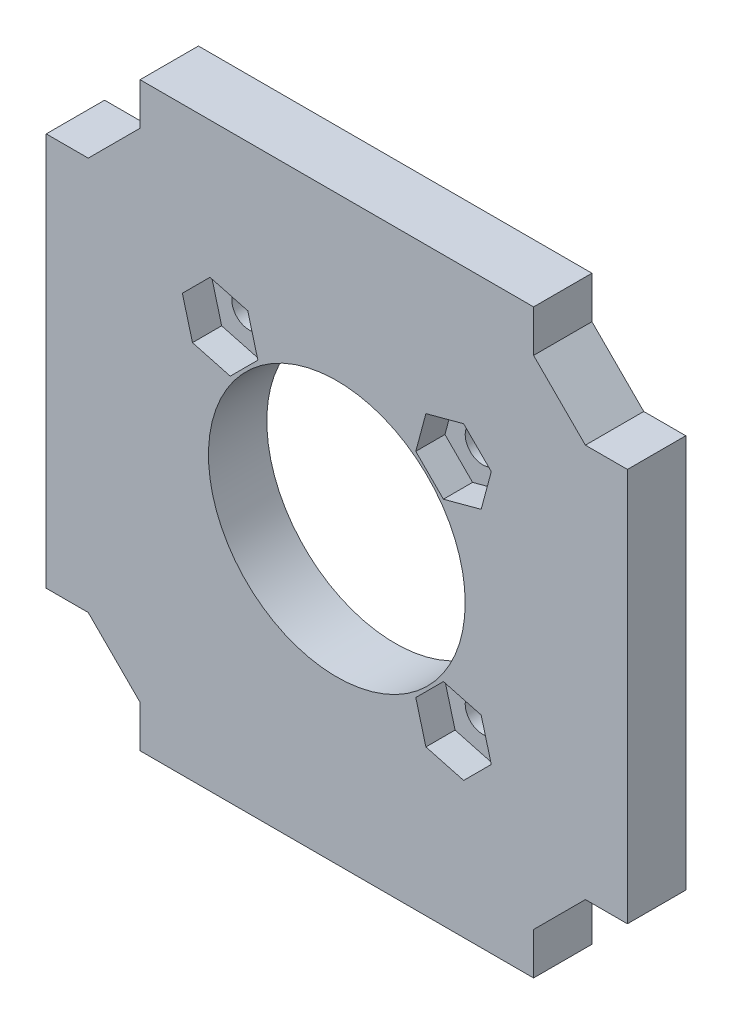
ISO-10303-21;
HEADER;
FILE_DESCRIPTION(('STEP AP214'),'2;1');
FILE_NAME('part.step','',(''),(''),'','','');
FILE_SCHEMA(('AUTOMOTIVE_DESIGN { 1 0 10303 214 1 1 1 1 }'));
ENDSEC;
DATA;
#1=APPLICATION_CONTEXT('core data for automotive mechanical design processes');
#2=APPLICATION_PROTOCOL_DEFINITION('international standard','automotive_design',2000,#1);
#3=PRODUCT_CONTEXT('',#1,'mechanical');
#4=PRODUCT('Part','Part','',(#3));
#5=PRODUCT_RELATED_PRODUCT_CATEGORY('part','',(#4));
#6=PRODUCT_DEFINITION_FORMATION('','',#4);
#7=PRODUCT_DEFINITION_CONTEXT('part definition',#1,'design');
#8=PRODUCT_DEFINITION('design','',#6,#7);
#9=PRODUCT_DEFINITION_SHAPE('','',#8);
#10=(LENGTH_UNIT() NAMED_UNIT(*) SI_UNIT(.MILLI.,.METRE.));
#11=(NAMED_UNIT(*) PLANE_ANGLE_UNIT() SI_UNIT($,.RADIAN.));
#12=(NAMED_UNIT(*) SI_UNIT($,.STERADIAN.) SOLID_ANGLE_UNIT());
#13=UNCERTAINTY_MEASURE_WITH_UNIT(LENGTH_MEASURE(1.E-05),#10,'distance_accuracy_value','');
#14=(GEOMETRIC_REPRESENTATION_CONTEXT(3) GLOBAL_UNCERTAINTY_ASSIGNED_CONTEXT((#13)) GLOBAL_UNIT_ASSIGNED_CONTEXT((#10,
#11,#12)) REPRESENTATION_CONTEXT('',''));
#15=CARTESIAN_POINT('',(0.,0.,0.));
#16=DIRECTION('',(0.,0.,1.));
#17=DIRECTION('',(1.,0.,0.));
#18=AXIS2_PLACEMENT_3D('',#15,#16,#17);
#19=CARTESIAN_POINT('',(0.,0.,5.));
#20=DIRECTION('',(0.,0.,1.));
#21=DIRECTION('',(1.,0.,0.));
#22=AXIS2_PLACEMENT_3D('',#19,#20,#21);
#23=PLANE('',#22);
#24=DIRECTION('',(-0.707106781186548,-0.707106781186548,0.));
#25=VECTOR('',#24,1.);
#26=CARTESIAN_POINT('',(12.050609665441,-12.050609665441,5.));
#27=LINE('',#26,#25);
#28=CARTESIAN_POINT('',(13.2345297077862,-10.8666896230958,5.));
#29=VERTEX_POINT('',#28);
#30=CARTESIAN_POINT('',(10.8666896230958,-13.2345297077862,5.));
#31=VERTEX_POINT('',#30);
#32=EDGE_CURVE('E303',#29,#31,#27,.T.);
#33=ORIENTED_EDGE('',*,*,#32,.T.);
#34=DIRECTION('',(-0.965925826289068,0.258819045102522,0.));
#35=VECTOR('',#34,1.);
#36=CARTESIAN_POINT('',(-2.58070224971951,-9.63131191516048,5.));
#37=LINE('',#36,#35);
#38=CARTESIAN_POINT('',(7.6321599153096,-12.3678400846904,5.));
#39=VERTEX_POINT('',#38);
#40=EDGE_CURVE('E68',#31,#39,#37,.T.);
#41=ORIENTED_EDGE('',*,*,#40,.T.);
#42=DIRECTION('',(-0.258819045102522,0.965925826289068,0.));
#43=VECTOR('',#42,1.);
#44=CARTESIAN_POINT('',(4.02894212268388,1.07955178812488,5.));
#45=LINE('',#44,#43);
#46=CARTESIAN_POINT('',(6.7654702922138,-9.13331037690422,5.));
#47=VERTEX_POINT('',#46);
#48=EDGE_CURVE('E322',#39,#47,#45,.T.);
#49=ORIENTED_EDGE('',*,*,#48,.T.);
#50=DIRECTION('',(0.707106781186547,0.707106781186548,0.));
#51=VECTOR('',#50,1.);
#52=CARTESIAN_POINT('',(7.94939033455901,-7.94939033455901,5.));
#53=LINE('',#52,#51);
#54=CARTESIAN_POINT('',(9.13331037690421,-6.7654702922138,5.));
#55=VERTEX_POINT('',#54);
#56=EDGE_CURVE('E316',#47,#55,#53,.T.);
#57=ORIENTED_EDGE('',*,*,#56,.T.);
#58=DIRECTION('',(0.965925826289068,-0.258819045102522,0.));
#59=VECTOR('',#58,1.);
#60=CARTESIAN_POINT('',(-1.07955178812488,-4.02894212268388,5.));
#61=LINE('',#60,#59);
#62=CARTESIAN_POINT('',(12.3678400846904,-7.63215991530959,5.));
#63=VERTEX_POINT('',#62);
#64=EDGE_CURVE('E312',#55,#63,#61,.T.);
#65=ORIENTED_EDGE('',*,*,#64,.T.);
#66=DIRECTION('',(0.258819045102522,-0.965925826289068,0.));
#67=VECTOR('',#66,1.);
#68=CARTESIAN_POINT('',(9.63131191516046,2.58070224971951,5.));
#69=LINE('',#68,#67);
#70=EDGE_CURVE('E292',#63,#29,#69,.T.);
#71=ORIENTED_EDGE('',*,*,#70,.T.);
#72=EDGE_LOOP('',(#33,#41,#49,#57,#65,#71));
#73=FACE_BOUND('',#72,.T.);
#74=DIRECTION('',(0.707106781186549,-0.707106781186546,0.));
#75=VECTOR('',#74,1.);
#76=CARTESIAN_POINT('',(-19.0796847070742,-19.0796847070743,5.));
#77=LINE('',#76,#75);
#78=CARTESIAN_POINT('',(-21.3,-16.8593694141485,5.));
#79=VERTEX_POINT('',#78);
#80=CARTESIAN_POINT('',(-16.8593694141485,-21.3,5.));
#81=VERTEX_POINT('',#80);
#82=EDGE_CURVE('E498',#79,#81,#77,.T.);
#83=ORIENTED_EDGE('',*,*,#82,.T.);
#84=DIRECTION('',(0.,-1.,0.));
#85=VECTOR('',#84,1.);
#86=CARTESIAN_POINT('',(-16.8593694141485,0.,5.));
#87=LINE('',#86,#85);
#88=CARTESIAN_POINT('',(-16.8593694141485,-24.9,5.));
#89=VERTEX_POINT('',#88);
#90=EDGE_CURVE('E503',#81,#89,#87,.T.);
#91=ORIENTED_EDGE('',*,*,#90,.T.);
#92=DIRECTION('',(1.,0.,0.));
#93=VECTOR('',#92,1.);
#94=CARTESIAN_POINT('',(0.,-24.9,5.));
#95=LINE('',#94,#93);
#96=CARTESIAN_POINT('',(16.8593694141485,-24.9,5.));
#97=VERTEX_POINT('',#96);
#98=EDGE_CURVE('E506',#89,#97,#95,.T.);
#99=ORIENTED_EDGE('',*,*,#98,.T.);
#100=DIRECTION('',(0.,1.,0.));
#101=VECTOR('',#100,1.);
#102=CARTESIAN_POINT('',(16.8593694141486,0.,5.));
#103=LINE('',#102,#101);
#104=CARTESIAN_POINT('',(16.8593694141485,-21.3,5.));
#105=VERTEX_POINT('',#104);
#106=EDGE_CURVE('E509',#97,#105,#103,.T.);
#107=ORIENTED_EDGE('',*,*,#106,.T.);
#108=DIRECTION('',(0.707106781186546,0.707106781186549,0.));
#109=VECTOR('',#108,1.);
#110=CARTESIAN_POINT('',(19.0796847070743,-19.0796847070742,5.));
#111=LINE('',#110,#109);
#112=CARTESIAN_POINT('',(21.3,-16.8593694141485,5.));
#113=VERTEX_POINT('',#112);
#114=EDGE_CURVE('E512',#105,#113,#111,.T.);
#115=ORIENTED_EDGE('',*,*,#114,.T.);
#116=DIRECTION('',(1.,0.,0.));
#117=VECTOR('',#116,1.);
#118=CARTESIAN_POINT('',(0.,-16.8593694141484,5.));
#119=LINE('',#118,#117);
#120=CARTESIAN_POINT('',(24.9,-16.8593694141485,5.));
#121=VERTEX_POINT('',#120);
#122=EDGE_CURVE('E515',#113,#121,#119,.T.);
#123=ORIENTED_EDGE('',*,*,#122,.T.);
#124=DIRECTION('',(0.,1.,0.));
#125=VECTOR('',#124,1.);
#126=CARTESIAN_POINT('',(24.9,0.,5.));
#127=LINE('',#126,#125);
#128=CARTESIAN_POINT('',(24.9,16.8593694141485,5.));
#129=VERTEX_POINT('',#128);
#130=EDGE_CURVE('E518',#121,#129,#127,.T.);
#131=ORIENTED_EDGE('',*,*,#130,.T.);
#132=DIRECTION('',(-1.,0.,0.));
#133=VECTOR('',#132,1.);
#134=CARTESIAN_POINT('',(0.,16.8593694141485,5.));
#135=LINE('',#134,#133);
#136=CARTESIAN_POINT('',(21.3,16.8593694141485,5.));
#137=VERTEX_POINT('',#136);
#138=EDGE_CURVE('E521',#129,#137,#135,.T.);
#139=ORIENTED_EDGE('',*,*,#138,.T.);
#140=DIRECTION('',(-0.707106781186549,0.707106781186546,0.));
#141=VECTOR('',#140,1.);
#142=CARTESIAN_POINT('',(19.0796847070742,19.0796847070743,5.));
#143=LINE('',#142,#141);
#144=CARTESIAN_POINT('',(16.8593694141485,21.3,5.));
#145=VERTEX_POINT('',#144);
#146=EDGE_CURVE('E524',#137,#145,#143,.T.);
#147=ORIENTED_EDGE('',*,*,#146,.T.);
#148=DIRECTION('',(0.,1.,0.));
#149=VECTOR('',#148,1.);
#150=CARTESIAN_POINT('',(16.8593694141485,0.,5.));
#151=LINE('',#150,#149);
#152=CARTESIAN_POINT('',(16.8593694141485,24.9,5.));
#153=VERTEX_POINT('',#152);
#154=EDGE_CURVE('E527',#145,#153,#151,.T.);
#155=ORIENTED_EDGE('',*,*,#154,.T.);
#156=DIRECTION('',(1.,0.,0.));
#157=VECTOR('',#156,1.);
#158=CARTESIAN_POINT('',(0.,24.9,5.));
#159=LINE('',#158,#157);
#160=CARTESIAN_POINT('',(-16.8593694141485,24.9,5.));
#161=VERTEX_POINT('',#160);
#162=EDGE_CURVE('E530',#161,#153,#159,.T.);
#163=ORIENTED_EDGE('',*,*,#162,.F.);
#164=DIRECTION('',(0.,-1.,0.));
#165=VECTOR('',#164,1.);
#166=CARTESIAN_POINT('',(-16.8593694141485,0.,5.));
#167=LINE('',#166,#165);
#168=CARTESIAN_POINT('',(-16.8593694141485,21.3,5.));
#169=VERTEX_POINT('',#168);
#170=EDGE_CURVE('E534',#161,#169,#167,.T.);
#171=ORIENTED_EDGE('',*,*,#170,.T.);
#172=DIRECTION('',(-0.707106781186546,-0.707106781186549,0.));
#173=VECTOR('',#172,1.);
#174=CARTESIAN_POINT('',(-19.0796847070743,19.0796847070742,5.));
#175=LINE('',#174,#173);
#176=CARTESIAN_POINT('',(-21.3,16.8593694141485,5.));
#177=VERTEX_POINT('',#176);
#178=EDGE_CURVE('E537',#169,#177,#175,.T.);
#179=ORIENTED_EDGE('',*,*,#178,.T.);
#180=DIRECTION('',(-1.,0.,0.));
#181=VECTOR('',#180,1.);
#182=CARTESIAN_POINT('',(0.,16.8593694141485,5.));
#183=LINE('',#182,#181);
#184=CARTESIAN_POINT('',(-24.9,16.8593694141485,5.));
#185=VERTEX_POINT('',#184);
#186=EDGE_CURVE('E540',#177,#185,#183,.T.);
#187=ORIENTED_EDGE('',*,*,#186,.T.);
#188=DIRECTION('',(0.,1.,0.));
#189=VECTOR('',#188,1.);
#190=CARTESIAN_POINT('',(-24.9,0.,5.));
#191=LINE('',#190,#189);
#192=CARTESIAN_POINT('',(-24.9,-16.8593694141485,5.));
#193=VERTEX_POINT('',#192);
#194=EDGE_CURVE('E543',#193,#185,#191,.T.);
#195=ORIENTED_EDGE('',*,*,#194,.F.);
#196=DIRECTION('',(1.,0.,0.));
#197=VECTOR('',#196,1.);
#198=CARTESIAN_POINT('',(0.,-16.8593694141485,5.));
#199=LINE('',#198,#197);
#200=EDGE_CURVE('E547',#193,#79,#199,.T.);
#201=ORIENTED_EDGE('',*,*,#200,.T.);
#202=EDGE_LOOP('',(#83,#91,#99,#107,#115,#123,#131,#139,#147,#155,#163,#171,#179,#187,#195,#201));
#203=FACE_BOUND('',#202,.T.);
#204=CARTESIAN_POINT('',(0.,0.,5.));
#205=DIRECTION('',(0.,0.,1.));
#206=DIRECTION('',(1.,0.,0.));
#207=AXIS2_PLACEMENT_3D('',#204,#205,#206);
#208=CIRCLE('',#207,11.);
#209=CARTESIAN_POINT('',(11.,0.,5.));
#210=VERTEX_POINT('',#209);
#211=EDGE_CURVE('E494',#210,#210,#208,.T.);
#212=ORIENTED_EDGE('',*,*,#211,.F.);
#213=EDGE_LOOP('',(#212));
#214=FACE_BOUND('',#213,.T.);
#215=DIRECTION('',(-0.965925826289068,-0.258819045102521,0.));
#216=VECTOR('',#215,1.);
#217=CARTESIAN_POINT('',(-1.07955178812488,4.02894212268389,5.));
#218=LINE('',#217,#216);
#219=CARTESIAN_POINT('',(12.3678400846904,7.63215991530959,5.));
#220=VERTEX_POINT('',#219);
#221=CARTESIAN_POINT('',(9.13331037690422,6.76547029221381,5.));
#222=VERTEX_POINT('',#221);
#223=EDGE_CURVE('E411',#220,#222,#218,.T.);
#224=ORIENTED_EDGE('',*,*,#223,.T.);
#225=DIRECTION('',(-0.707106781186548,0.707106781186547,0.));
#226=VECTOR('',#225,1.);
#227=CARTESIAN_POINT('',(7.94939033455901,7.94939033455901,5.));
#228=LINE('',#227,#226);
#229=CARTESIAN_POINT('',(6.7654702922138,9.13331037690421,5.));
#230=VERTEX_POINT('',#229);
#231=EDGE_CURVE('E328',#222,#230,#228,.T.);
#232=ORIENTED_EDGE('',*,*,#231,.T.);
#233=DIRECTION('',(0.258819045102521,0.965925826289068,0.));
#234=VECTOR('',#233,1.);
#235=CARTESIAN_POINT('',(4.02894212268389,-1.07955178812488,5.));
#236=LINE('',#235,#234);
#237=CARTESIAN_POINT('',(7.63215991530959,12.3678400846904,5.));
#238=VERTEX_POINT('',#237);
#239=EDGE_CURVE('E430',#230,#238,#236,.T.);
#240=ORIENTED_EDGE('',*,*,#239,.T.);
#241=DIRECTION('',(0.965925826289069,0.258819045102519,0.));
#242=VECTOR('',#241,1.);
#243=CARTESIAN_POINT('',(-2.58070224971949,9.63131191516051,5.));
#244=LINE('',#243,#242);
#245=CARTESIAN_POINT('',(10.8666896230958,13.2345297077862,5.));
#246=VERTEX_POINT('',#245);
#247=EDGE_CURVE('E434',#238,#246,#244,.T.);
#248=ORIENTED_EDGE('',*,*,#247,.T.);
#249=DIRECTION('',(0.707106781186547,-0.707106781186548,0.));
#250=VECTOR('',#249,1.);
#251=CARTESIAN_POINT('',(12.050609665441,12.050609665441,5.));
#252=LINE('',#251,#250);
#253=CARTESIAN_POINT('',(13.2345297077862,10.8666896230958,5.));
#254=VERTEX_POINT('',#253);
#255=EDGE_CURVE('E438',#246,#254,#252,.T.);
#256=ORIENTED_EDGE('',*,*,#255,.T.);
#257=DIRECTION('',(-0.258819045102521,-0.965925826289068,0.));
#258=VECTOR('',#257,1.);
#259=CARTESIAN_POINT('',(9.63131191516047,-2.5807022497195,5.));
#260=LINE('',#259,#258);
#261=EDGE_CURVE('E442',#254,#220,#260,.T.);
#262=ORIENTED_EDGE('',*,*,#261,.T.);
#263=EDGE_LOOP('',(#224,#232,#240,#248,#256,#262));
#264=FACE_BOUND('',#263,.T.);
#265=DIRECTION('',(-0.965925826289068,0.258819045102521,0.));
#266=VECTOR('',#265,1.);
#267=CARTESIAN_POINT('',(1.07955178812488,4.0289421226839,5.));
#268=LINE('',#267,#266);
#269=CARTESIAN_POINT('',(-9.13331037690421,6.76547029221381,5.));
#270=VERTEX_POINT('',#269);
#271=CARTESIAN_POINT('',(-12.3678400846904,7.6321599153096,5.));
#272=VERTEX_POINT('',#271);
#273=EDGE_CURVE('E365',#270,#272,#268,.T.);
#274=ORIENTED_EDGE('',*,*,#273,.T.);
#275=DIRECTION('',(-0.258819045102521,0.965925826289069,0.));
#276=VECTOR('',#275,1.);
#277=CARTESIAN_POINT('',(-9.6313119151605,-2.5807022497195,5.));
#278=LINE('',#277,#276);
#279=CARTESIAN_POINT('',(-13.2345297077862,10.8666896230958,5.));
#280=VERTEX_POINT('',#279);
#281=EDGE_CURVE('E60',#272,#280,#278,.T.);
#282=ORIENTED_EDGE('',*,*,#281,.T.);
#283=DIRECTION('',(0.707106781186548,0.707106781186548,0.));
#284=VECTOR('',#283,1.);
#285=CARTESIAN_POINT('',(-12.050609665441,12.050609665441,5.));
#286=LINE('',#285,#284);
#287=CARTESIAN_POINT('',(-10.8666896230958,13.2345297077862,5.));
#288=VERTEX_POINT('',#287);
#289=EDGE_CURVE('E382',#280,#288,#286,.T.);
#290=ORIENTED_EDGE('',*,*,#289,.T.);
#291=DIRECTION('',(0.965925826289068,-0.258819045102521,0.));
#292=VECTOR('',#291,1.);
#293=CARTESIAN_POINT('',(2.58070224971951,9.63131191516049,5.));
#294=LINE('',#293,#292);
#295=CARTESIAN_POINT('',(-7.63215991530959,12.3678400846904,5.));
#296=VERTEX_POINT('',#295);
#297=EDGE_CURVE('E378',#288,#296,#294,.T.);
#298=ORIENTED_EDGE('',*,*,#297,.T.);
#299=DIRECTION('',(0.258819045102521,-0.965925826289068,0.));
#300=VECTOR('',#299,1.);
#301=CARTESIAN_POINT('',(-4.02894212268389,-1.07955178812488,5.));
#302=LINE('',#301,#300);
#303=CARTESIAN_POINT('',(-6.7654702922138,9.13331037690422,5.));
#304=VERTEX_POINT('',#303);
#305=EDGE_CURVE('E374',#296,#304,#302,.T.);
#306=ORIENTED_EDGE('',*,*,#305,.T.);
#307=DIRECTION('',(-0.707106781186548,-0.707106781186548,0.));
#308=VECTOR('',#307,1.);
#309=CARTESIAN_POINT('',(-7.94939033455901,7.94939033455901,5.));
#310=LINE('',#309,#308);
#311=EDGE_CURVE('E369',#304,#270,#310,.T.);
#312=ORIENTED_EDGE('',*,*,#311,.T.);
#313=EDGE_LOOP('',(#274,#282,#290,#298,#306,#312));
#314=FACE_BOUND('',#313,.T.);
#315=ADVANCED_FACE('F41',(#73,#203,#214,#264,#314),#23,.T.);
#316=CARTESIAN_POINT('',(-19.0796847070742,-19.0796847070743,5.));
#317=DIRECTION('',(0.707106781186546,0.707106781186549,0.));
#318=DIRECTION('',(-0.707106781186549,0.707106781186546,0.));
#319=AXIS2_PLACEMENT_3D('',#316,#317,#318);
#320=PLANE('',#319);
#321=DIRECTION('',(0.707106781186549,-0.707106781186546,0.));
#322=VECTOR('',#321,1.);
#323=CARTESIAN_POINT('',(-19.0796847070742,-19.0796847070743,0.));
#324=LINE('',#323,#322);
#325=CARTESIAN_POINT('',(-21.3,-16.8593694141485,0.));
#326=VERTEX_POINT('',#325);
#327=CARTESIAN_POINT('',(-16.8593694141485,-21.3,0.));
#328=VERTEX_POINT('',#327);
#329=EDGE_CURVE('E556',#326,#328,#324,.T.);
#330=ORIENTED_EDGE('',*,*,#329,.T.);
#331=DIRECTION('',(0.,0.,-1.));
#332=VECTOR('',#331,1.);
#333=CARTESIAN_POINT('',(-16.8593694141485,-21.3,5.));
#334=LINE('',#333,#332);
#335=EDGE_CURVE('E663',#81,#328,#334,.T.);
#336=ORIENTED_EDGE('',*,*,#335,.F.);
#337=ORIENTED_EDGE('',*,*,#82,.F.);
#338=DIRECTION('',(0.,0.,-1.));
#339=VECTOR('',#338,1.);
#340=CARTESIAN_POINT('',(-21.3,-16.8593694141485,5.));
#341=LINE('',#340,#339);
#342=EDGE_CURVE('E550',#79,#326,#341,.T.);
#343=ORIENTED_EDGE('',*,*,#342,.T.);
#344=EDGE_LOOP('',(#330,#336,#337,#343));
#345=FACE_BOUND('',#344,.T.);
#346=ADVANCED_FACE('F701',(#345),#320,.F.);
#347=CARTESIAN_POINT('',(-16.8593694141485,0.,5.));
#348=DIRECTION('',(1.,0.,0.));
#349=DIRECTION('',(0.,0.,-1.));
#350=AXIS2_PLACEMENT_3D('',#347,#348,#349);
#351=PLANE('',#350);
#352=DIRECTION('',(0.,-1.,0.));
#353=VECTOR('',#352,1.);
#354=CARTESIAN_POINT('',(-16.8593694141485,0.,0.));
#355=LINE('',#354,#353);
#356=CARTESIAN_POINT('',(-16.8593694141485,-24.9,0.));
#357=VERTEX_POINT('',#356);
#358=EDGE_CURVE('E560',#328,#357,#355,.T.);
#359=ORIENTED_EDGE('',*,*,#358,.T.);
#360=DIRECTION('',(0.,0.,-1.));
#361=VECTOR('',#360,1.);
#362=CARTESIAN_POINT('',(-16.8593694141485,-24.9,5.));
#363=LINE('',#362,#361);
#364=EDGE_CURVE('E659',#89,#357,#363,.T.);
#365=ORIENTED_EDGE('',*,*,#364,.F.);
#366=ORIENTED_EDGE('',*,*,#90,.F.);
#367=ORIENTED_EDGE('',*,*,#335,.T.);
#368=EDGE_LOOP('',(#359,#365,#366,#367));
#369=FACE_BOUND('',#368,.T.);
#370=ADVANCED_FACE('F747',(#369),#351,.F.);
#371=CARTESIAN_POINT('',(0.,-24.9,5.));
#372=DIRECTION('',(0.,1.,0.));
#373=DIRECTION('',(0.,0.,1.));
#374=AXIS2_PLACEMENT_3D('',#371,#372,#373);
#375=PLANE('',#374);
#376=DIRECTION('',(1.,0.,0.));
#377=VECTOR('',#376,1.);
#378=CARTESIAN_POINT('',(0.,-24.9,0.));
#379=LINE('',#378,#377);
#380=CARTESIAN_POINT('',(16.8593694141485,-24.9,0.));
#381=VERTEX_POINT('',#380);
#382=EDGE_CURVE('E563',#357,#381,#379,.T.);
#383=ORIENTED_EDGE('',*,*,#382,.T.);
#384=DIRECTION('',(0.,0.,-1.));
#385=VECTOR('',#384,1.);
#386=CARTESIAN_POINT('',(16.8593694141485,-24.9,5.));
#387=LINE('',#386,#385);
#388=EDGE_CURVE('E655',#97,#381,#387,.T.);
#389=ORIENTED_EDGE('',*,*,#388,.F.);
#390=ORIENTED_EDGE('',*,*,#98,.F.);
#391=ORIENTED_EDGE('',*,*,#364,.T.);
#392=EDGE_LOOP('',(#383,#389,#390,#391));
#393=FACE_BOUND('',#392,.T.);
#394=ADVANCED_FACE('F806',(#393),#375,.F.);
#395=CARTESIAN_POINT('',(16.8593694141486,0.,5.));
#396=DIRECTION('',(-1.,0.,0.));
#397=DIRECTION('',(0.,-1.,0.));
#398=AXIS2_PLACEMENT_3D('',#395,#396,#397);
#399=PLANE('',#398);
#400=DIRECTION('',(0.,1.,0.));
#401=VECTOR('',#400,1.);
#402=CARTESIAN_POINT('',(16.8593694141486,0.,0.));
#403=LINE('',#402,#401);
#404=CARTESIAN_POINT('',(16.8593694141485,-21.3,0.));
#405=VERTEX_POINT('',#404);
#406=EDGE_CURVE('E566',#381,#405,#403,.T.);
#407=ORIENTED_EDGE('',*,*,#406,.T.);
#408=DIRECTION('',(0.,0.,-1.));
#409=VECTOR('',#408,1.);
#410=CARTESIAN_POINT('',(16.8593694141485,-21.3,5.));
#411=LINE('',#410,#409);
#412=EDGE_CURVE('E651',#105,#405,#411,.T.);
#413=ORIENTED_EDGE('',*,*,#412,.F.);
#414=ORIENTED_EDGE('',*,*,#106,.F.);
#415=ORIENTED_EDGE('',*,*,#388,.T.);
#416=EDGE_LOOP('',(#407,#413,#414,#415));
#417=FACE_BOUND('',#416,.T.);
#418=ADVANCED_FACE('F802',(#417),#399,.F.);
#419=CARTESIAN_POINT('',(19.0796847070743,-19.0796847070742,5.));
#420=DIRECTION('',(-0.707106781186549,0.707106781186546,0.));
#421=DIRECTION('',(-0.707106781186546,-0.707106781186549,0.));
#422=AXIS2_PLACEMENT_3D('',#419,#420,#421);
#423=PLANE('',#422);
#424=DIRECTION('',(0.707106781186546,0.707106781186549,0.));
#425=VECTOR('',#424,1.);
#426=CARTESIAN_POINT('',(19.0796847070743,-19.0796847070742,0.));
#427=LINE('',#426,#425);
#428=CARTESIAN_POINT('',(21.3,-16.8593694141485,0.));
#429=VERTEX_POINT('',#428);
#430=EDGE_CURVE('E569',#405,#429,#427,.T.);
#431=ORIENTED_EDGE('',*,*,#430,.T.);
#432=DIRECTION('',(0.,0.,-1.));
#433=VECTOR('',#432,1.);
#434=CARTESIAN_POINT('',(21.3,-16.8593694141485,5.));
#435=LINE('',#434,#433);
#436=EDGE_CURVE('E647',#113,#429,#435,.T.);
#437=ORIENTED_EDGE('',*,*,#436,.F.);
#438=ORIENTED_EDGE('',*,*,#114,.F.);
#439=ORIENTED_EDGE('',*,*,#412,.T.);
#440=EDGE_LOOP('',(#431,#437,#438,#439));
#441=FACE_BOUND('',#440,.T.);
#442=ADVANCED_FACE('F798',(#441),#423,.F.);
#443=CARTESIAN_POINT('',(0.,-16.8593694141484,5.));
#444=DIRECTION('',(0.,1.,0.));
#445=DIRECTION('',(-1.,0.,0.));
#446=AXIS2_PLACEMENT_3D('',#443,#444,#445);
#447=PLANE('',#446);
#448=DIRECTION('',(1.,0.,0.));
#449=VECTOR('',#448,1.);
#450=CARTESIAN_POINT('',(0.,-16.8593694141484,0.));
#451=LINE('',#450,#449);
#452=CARTESIAN_POINT('',(24.9,-16.8593694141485,0.));
#453=VERTEX_POINT('',#452);
#454=EDGE_CURVE('E572',#429,#453,#451,.T.);
#455=ORIENTED_EDGE('',*,*,#454,.T.);
#456=DIRECTION('',(0.,0.,-1.));
#457=VECTOR('',#456,1.);
#458=CARTESIAN_POINT('',(24.9,-16.8593694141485,5.));
#459=LINE('',#458,#457);
#460=EDGE_CURVE('E643',#121,#453,#459,.T.);
#461=ORIENTED_EDGE('',*,*,#460,.F.);
#462=ORIENTED_EDGE('',*,*,#122,.F.);
#463=ORIENTED_EDGE('',*,*,#436,.T.);
#464=EDGE_LOOP('',(#455,#461,#462,#463));
#465=FACE_BOUND('',#464,.T.);
#466=ADVANCED_FACE('F794',(#465),#447,.F.);
#467=CARTESIAN_POINT('',(24.9,0.,5.));
#468=DIRECTION('',(-1.,0.,0.));
#469=DIRECTION('',(0.,0.,1.));
#470=AXIS2_PLACEMENT_3D('',#467,#468,#469);
#471=PLANE('',#470);
#472=DIRECTION('',(0.,1.,0.));
#473=VECTOR('',#472,1.);
#474=CARTESIAN_POINT('',(24.9,0.,0.));
#475=LINE('',#474,#473);
#476=CARTESIAN_POINT('',(24.9,16.8593694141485,0.));
#477=VERTEX_POINT('',#476);
#478=EDGE_CURVE('E575',#453,#477,#475,.T.);
#479=ORIENTED_EDGE('',*,*,#478,.T.);
#480=DIRECTION('',(0.,0.,-1.));
#481=VECTOR('',#480,1.);
#482=CARTESIAN_POINT('',(24.9,16.8593694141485,5.));
#483=LINE('',#482,#481);
#484=EDGE_CURVE('E639',#129,#477,#483,.T.);
#485=ORIENTED_EDGE('',*,*,#484,.F.);
#486=ORIENTED_EDGE('',*,*,#130,.F.);
#487=ORIENTED_EDGE('',*,*,#460,.T.);
#488=EDGE_LOOP('',(#479,#485,#486,#487));
#489=FACE_BOUND('',#488,.T.);
#490=ADVANCED_FACE('F790',(#489),#471,.F.);
#491=CARTESIAN_POINT('',(0.,16.8593694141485,5.));
#492=DIRECTION('',(0.,-1.,0.));
#493=DIRECTION('',(0.,0.,-1.));
#494=AXIS2_PLACEMENT_3D('',#491,#492,#493);
#495=PLANE('',#494);
#496=DIRECTION('',(-1.,0.,0.));
#497=VECTOR('',#496,1.);
#498=CARTESIAN_POINT('',(0.,16.8593694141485,0.));
#499=LINE('',#498,#497);
#500=CARTESIAN_POINT('',(21.3,16.8593694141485,0.));
#501=VERTEX_POINT('',#500);
#502=EDGE_CURVE('E578',#477,#501,#499,.T.);
#503=ORIENTED_EDGE('',*,*,#502,.T.);
#504=DIRECTION('',(0.,0.,-1.));
#505=VECTOR('',#504,1.);
#506=CARTESIAN_POINT('',(21.3,16.8593694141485,5.));
#507=LINE('',#506,#505);
#508=EDGE_CURVE('E635',#137,#501,#507,.T.);
#509=ORIENTED_EDGE('',*,*,#508,.F.);
#510=ORIENTED_EDGE('',*,*,#138,.F.);
#511=ORIENTED_EDGE('',*,*,#484,.T.);
#512=EDGE_LOOP('',(#503,#509,#510,#511));
#513=FACE_BOUND('',#512,.T.);
#514=ADVANCED_FACE('F786',(#513),#495,.F.);
#515=CARTESIAN_POINT('',(19.0796847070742,19.0796847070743,5.));
#516=DIRECTION('',(-0.707106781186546,-0.707106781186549,0.));
#517=DIRECTION('',(0.707106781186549,-0.707106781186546,0.));
#518=AXIS2_PLACEMENT_3D('',#515,#516,#517);
#519=PLANE('',#518);
#520=DIRECTION('',(-0.707106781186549,0.707106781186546,0.));
#521=VECTOR('',#520,1.);
#522=CARTESIAN_POINT('',(19.0796847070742,19.0796847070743,0.));
#523=LINE('',#522,#521);
#524=CARTESIAN_POINT('',(16.8593694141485,21.3,0.));
#525=VERTEX_POINT('',#524);
#526=EDGE_CURVE('E581',#501,#525,#523,.T.);
#527=ORIENTED_EDGE('',*,*,#526,.T.);
#528=DIRECTION('',(0.,0.,-1.));
#529=VECTOR('',#528,1.);
#530=CARTESIAN_POINT('',(16.8593694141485,21.3,5.));
#531=LINE('',#530,#529);
#532=EDGE_CURVE('E631',#145,#525,#531,.T.);
#533=ORIENTED_EDGE('',*,*,#532,.F.);
#534=ORIENTED_EDGE('',*,*,#146,.F.);
#535=ORIENTED_EDGE('',*,*,#508,.T.);
#536=EDGE_LOOP('',(#527,#533,#534,#535));
#537=FACE_BOUND('',#536,.T.);
#538=ADVANCED_FACE('F782',(#537),#519,.F.);
#539=CARTESIAN_POINT('',(16.8593694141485,0.,5.));
#540=DIRECTION('',(-1.,0.,0.));
#541=DIRECTION('',(0.,0.,1.));
#542=AXIS2_PLACEMENT_3D('',#539,#540,#541);
#543=PLANE('',#542);
#544=DIRECTION('',(0.,1.,0.));
#545=VECTOR('',#544,1.);
#546=CARTESIAN_POINT('',(16.8593694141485,0.,0.));
#547=LINE('',#546,#545);
#548=CARTESIAN_POINT('',(16.8593694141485,24.9,0.));
#549=VERTEX_POINT('',#548);
#550=EDGE_CURVE('E584',#525,#549,#547,.T.);
#551=ORIENTED_EDGE('',*,*,#550,.T.);
#552=DIRECTION('',(0.,0.,-1.));
#553=VECTOR('',#552,1.);
#554=CARTESIAN_POINT('',(16.8593694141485,24.9,5.));
#555=LINE('',#554,#553);
#556=EDGE_CURVE('E628',#153,#549,#555,.T.);
#557=ORIENTED_EDGE('',*,*,#556,.F.);
#558=ORIENTED_EDGE('',*,*,#154,.F.);
#559=ORIENTED_EDGE('',*,*,#532,.T.);
#560=EDGE_LOOP('',(#551,#557,#558,#559));
#561=FACE_BOUND('',#560,.T.);
#562=ADVANCED_FACE('F778',(#561),#543,.F.);
#563=CARTESIAN_POINT('',(0.,24.9,5.));
#564=DIRECTION('',(0.,1.,0.));
#565=DIRECTION('',(0.,0.,1.));
#566=AXIS2_PLACEMENT_3D('',#563,#564,#565);
#567=PLANE('',#566);
#568=DIRECTION('',(1.,0.,0.));
#569=VECTOR('',#568,1.);
#570=CARTESIAN_POINT('',(0.,24.9,0.));
#571=LINE('',#570,#569);
#572=CARTESIAN_POINT('',(-16.8593694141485,24.9,0.));
#573=VERTEX_POINT('',#572);
#574=EDGE_CURVE('E588',#573,#549,#571,.T.);
#575=ORIENTED_EDGE('',*,*,#574,.F.);
#576=DIRECTION('',(0.,0.,-1.));
#577=VECTOR('',#576,1.);
#578=CARTESIAN_POINT('',(-16.8593694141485,24.9,5.));
#579=LINE('',#578,#577);
#580=EDGE_CURVE('E625',#161,#573,#579,.T.);
#581=ORIENTED_EDGE('',*,*,#580,.F.);
#582=ORIENTED_EDGE('',*,*,#162,.T.);
#583=ORIENTED_EDGE('',*,*,#556,.T.);
#584=EDGE_LOOP('',(#575,#581,#582,#583));
#585=FACE_BOUND('',#584,.T.);
#586=ADVANCED_FACE('F774',(#585),#567,.T.);
#587=CARTESIAN_POINT('',(-16.8593694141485,0.,5.));
#588=DIRECTION('',(1.,0.,0.));
#589=DIRECTION('',(0.,0.,-1.));
#590=AXIS2_PLACEMENT_3D('',#587,#588,#589);
#591=PLANE('',#590);
#592=DIRECTION('',(0.,-1.,0.));
#593=VECTOR('',#592,1.);
#594=CARTESIAN_POINT('',(-16.8593694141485,0.,0.));
#595=LINE('',#594,#593);
#596=CARTESIAN_POINT('',(-16.8593694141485,21.3,0.));
#597=VERTEX_POINT('',#596);
#598=EDGE_CURVE('E592',#573,#597,#595,.T.);
#599=ORIENTED_EDGE('',*,*,#598,.T.);
#600=DIRECTION('',(0.,0.,-1.));
#601=VECTOR('',#600,1.);
#602=CARTESIAN_POINT('',(-16.8593694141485,21.3,5.));
#603=LINE('',#602,#601);
#604=EDGE_CURVE('E621',#169,#597,#603,.T.);
#605=ORIENTED_EDGE('',*,*,#604,.F.);
#606=ORIENTED_EDGE('',*,*,#170,.F.);
#607=ORIENTED_EDGE('',*,*,#580,.T.);
#608=EDGE_LOOP('',(#599,#605,#606,#607));
#609=FACE_BOUND('',#608,.T.);
#610=ADVANCED_FACE('F770',(#609),#591,.F.);
#611=CARTESIAN_POINT('',(-19.0796847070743,19.0796847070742,5.));
#612=DIRECTION('',(0.707106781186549,-0.707106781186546,0.));
#613=DIRECTION('',(0.707106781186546,0.707106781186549,0.));
#614=AXIS2_PLACEMENT_3D('',#611,#612,#613);
#615=PLANE('',#614);
#616=DIRECTION('',(-0.707106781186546,-0.707106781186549,0.));
#617=VECTOR('',#616,1.);
#618=CARTESIAN_POINT('',(-19.0796847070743,19.0796847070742,0.));
#619=LINE('',#618,#617);
#620=CARTESIAN_POINT('',(-21.3,16.8593694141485,0.));
#621=VERTEX_POINT('',#620);
#622=EDGE_CURVE('E595',#597,#621,#619,.T.);
#623=ORIENTED_EDGE('',*,*,#622,.T.);
#624=DIRECTION('',(0.,0.,-1.));
#625=VECTOR('',#624,1.);
#626=CARTESIAN_POINT('',(-21.3,16.8593694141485,5.));
#627=LINE('',#626,#625);
#628=EDGE_CURVE('E617',#177,#621,#627,.T.);
#629=ORIENTED_EDGE('',*,*,#628,.F.);
#630=ORIENTED_EDGE('',*,*,#178,.F.);
#631=ORIENTED_EDGE('',*,*,#604,.T.);
#632=EDGE_LOOP('',(#623,#629,#630,#631));
#633=FACE_BOUND('',#632,.T.);
#634=ADVANCED_FACE('F766',(#633),#615,.F.);
#635=CARTESIAN_POINT('',(0.,16.8593694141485,5.));
#636=DIRECTION('',(0.,-1.,0.));
#637=DIRECTION('',(0.,0.,-1.));
#638=AXIS2_PLACEMENT_3D('',#635,#636,#637);
#639=PLANE('',#638);
#640=DIRECTION('',(-1.,0.,0.));
#641=VECTOR('',#640,1.);
#642=CARTESIAN_POINT('',(0.,16.8593694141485,0.));
#643=LINE('',#642,#641);
#644=CARTESIAN_POINT('',(-24.9,16.8593694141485,0.));
#645=VERTEX_POINT('',#644);
#646=EDGE_CURVE('E598',#621,#645,#643,.T.);
#647=ORIENTED_EDGE('',*,*,#646,.T.);
#648=DIRECTION('',(0.,0.,-1.));
#649=VECTOR('',#648,1.);
#650=CARTESIAN_POINT('',(-24.9,16.8593694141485,5.));
#651=LINE('',#650,#649);
#652=EDGE_CURVE('E614',#185,#645,#651,.T.);
#653=ORIENTED_EDGE('',*,*,#652,.F.);
#654=ORIENTED_EDGE('',*,*,#186,.F.);
#655=ORIENTED_EDGE('',*,*,#628,.T.);
#656=EDGE_LOOP('',(#647,#653,#654,#655));
#657=FACE_BOUND('',#656,.T.);
#658=ADVANCED_FACE('F762',(#657),#639,.F.);
#659=CARTESIAN_POINT('',(-24.9,0.,5.));
#660=DIRECTION('',(-1.,0.,0.));
#661=DIRECTION('',(0.,0.,1.));
#662=AXIS2_PLACEMENT_3D('',#659,#660,#661);
#663=PLANE('',#662);
#664=DIRECTION('',(0.,1.,0.));
#665=VECTOR('',#664,1.);
#666=CARTESIAN_POINT('',(-24.9,0.,0.));
#667=LINE('',#666,#665);
#668=CARTESIAN_POINT('',(-24.9,-16.8593694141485,0.));
#669=VERTEX_POINT('',#668);
#670=EDGE_CURVE('E602',#669,#645,#667,.T.);
#671=ORIENTED_EDGE('',*,*,#670,.F.);
#672=DIRECTION('',(0.,0.,-1.));
#673=VECTOR('',#672,1.);
#674=CARTESIAN_POINT('',(-24.9,-16.8593694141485,5.));
#675=LINE('',#674,#673);
#676=EDGE_CURVE('E611',#193,#669,#675,.T.);
#677=ORIENTED_EDGE('',*,*,#676,.F.);
#678=ORIENTED_EDGE('',*,*,#194,.T.);
#679=ORIENTED_EDGE('',*,*,#652,.T.);
#680=EDGE_LOOP('',(#671,#677,#678,#679));
#681=FACE_BOUND('',#680,.T.);
#682=ADVANCED_FACE('F699',(#681),#663,.T.);
#683=CARTESIAN_POINT('',(0.,0.,5.));
#684=DIRECTION('',(0.,0.,-1.));
#685=DIRECTION('',(-1.,0.,0.));
#686=AXIS2_PLACEMENT_3D('',#683,#684,#685);
#687=CYLINDRICAL_SURFACE('',#686,11.);
#688=ORIENTED_EDGE('',*,*,#211,.T.);
#689=EDGE_LOOP('',(#688));
#690=FACE_BOUND('',#689,.T.);
#691=CARTESIAN_POINT('',(0.,0.,0.));
#692=DIRECTION('',(0.,0.,1.));
#693=DIRECTION('',(1.,0.,0.));
#694=AXIS2_PLACEMENT_3D('',#691,#692,#693);
#695=CIRCLE('',#694,11.);
#696=CARTESIAN_POINT('',(4.67173324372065,9.9586599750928,0.));
#697=VERTEX_POINT('',#696);
#698=CARTESIAN_POINT('',(-4.67173324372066,9.95865997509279,0.));
#699=VERTEX_POINT('',#698);
#700=EDGE_CURVE('E555',#697,#699,#695,.T.);
#701=ORIENTED_EDGE('',*,*,#700,.F.);
#702=CARTESIAN_POINT('',(4.67173324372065,9.9586599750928,0.));
#703=CARTESIAN_POINT('',(4.7754986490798,9.90999914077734,3.60077493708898E-05));
#704=CARTESIAN_POINT('',(4.87839470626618,9.85973487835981,-0.00533910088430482));
#705=CARTESIAN_POINT('',(5.08161939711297,9.75653692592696,-0.0257025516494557));
#706=CARTESIAN_POINT('',(5.18195290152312,9.70360897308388,-0.0406709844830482));
#707=CARTESIAN_POINT('',(5.37751181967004,9.59659074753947,-0.0786054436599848));
#708=CARTESIAN_POINT('',(5.47280084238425,9.54255066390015,-0.101390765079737));
#709=CARTESIAN_POINT('',(5.66035103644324,9.43251005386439,-0.153719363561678));
#710=CARTESIAN_POINT('',(5.75261132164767,9.37650896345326,-0.183264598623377));
#711=CARTESIAN_POINT('',(5.97002520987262,9.24019326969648,-0.260469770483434));
#712=CARTESIAN_POINT('',(6.09373517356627,9.15903313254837,-0.310669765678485));
#713=CARTESIAN_POINT('',(6.33608280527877,8.99309140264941,-0.417215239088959));
#714=CARTESIAN_POINT('',(6.45471485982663,8.90830599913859,-0.473567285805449));
#715=CARTESIAN_POINT('',(6.63017984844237,8.77758757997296,-0.558661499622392));
#716=CARTESIAN_POINT('',(6.68837772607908,8.73332493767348,-0.587183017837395));
#717=CARTESIAN_POINT('',(6.80411809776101,8.6434571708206,-0.643479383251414));
#718=CARTESIAN_POINT('',(6.86166048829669,8.59785183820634,-0.671254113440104));
#719=CARTESIAN_POINT('',(6.97624478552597,8.50514139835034,-0.724952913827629));
#720=CARTESIAN_POINT('',(7.03328733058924,8.45803872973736,-0.750879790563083));
#721=CARTESIAN_POINT('',(7.14716944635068,8.36202802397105,-0.799637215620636));
#722=CARTESIAN_POINT('',(7.20400907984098,8.31312061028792,-0.822468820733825));
#723=CARTESIAN_POINT('',(7.31265469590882,8.21765423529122,-0.861745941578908));
#724=CARTESIAN_POINT('',(7.3644667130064,8.17126325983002,-0.878575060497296));
#725=CARTESIAN_POINT('',(7.46796612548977,8.07678080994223,-0.907192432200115));
#726=CARTESIAN_POINT('',(7.51965352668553,8.02868941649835,-0.918980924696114));
#727=CARTESIAN_POINT('',(7.62213583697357,7.93145517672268,-0.936367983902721));
#728=CARTESIAN_POINT('',(7.67293452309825,7.88232733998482,-0.942026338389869));
#729=CARTESIAN_POINT('',(7.77372434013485,7.78294412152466,-0.946783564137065));
#730=CARTESIAN_POINT('',(7.82371556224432,7.73268886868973,-0.945883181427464));
#731=CARTESIAN_POINT('',(7.93349994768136,7.62017429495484,-0.936676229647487));
#732=CARTESIAN_POINT('',(7.99298389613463,7.55774474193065,-0.926757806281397));
#733=CARTESIAN_POINT('',(8.109560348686,7.43252106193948,-0.898637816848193));
#734=CARTESIAN_POINT('',(8.16665100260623,7.36972669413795,-0.880429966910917));
#735=CARTESIAN_POINT('',(8.27916788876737,7.24311159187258,-0.837543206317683));
#736=CARTESIAN_POINT('',(8.33455590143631,7.17928969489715,-0.812770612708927));
#737=CARTESIAN_POINT('',(8.44302243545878,7.05141180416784,-0.759057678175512));
#738=CARTESIAN_POINT('',(8.49609950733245,6.98735569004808,-0.730114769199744));
#739=CARTESIAN_POINT('',(8.60508591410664,6.85278579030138,-0.667141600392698));
#740=CARTESIAN_POINT('',(8.66080306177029,6.78222277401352,-0.632888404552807));
#741=CARTESIAN_POINT('',(8.7702919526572,6.64003212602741,-0.563566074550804));
#742=CARTESIAN_POINT('',(8.82406409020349,6.56840471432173,-0.528497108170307));
#743=CARTESIAN_POINT('',(8.93005248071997,6.42356760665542,-0.45903264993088));
#744=CARTESIAN_POINT('',(8.98226729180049,6.35035654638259,-0.424637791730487));
#745=CARTESIAN_POINT('',(9.08529927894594,6.20205510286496,-0.357820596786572));
#746=CARTESIAN_POINT('',(9.13611637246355,6.1269646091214,-0.325398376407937));
#747=CARTESIAN_POINT('',(9.23569039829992,5.97579201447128,-0.264085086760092));
#748=CARTESIAN_POINT('',(9.28446673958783,5.89974132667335,-0.235148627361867));
#749=CARTESIAN_POINT('',(9.38072144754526,5.74546154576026,-0.18120171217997));
#750=CARTESIAN_POINT('',(9.42820004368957,5.66723284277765,-0.156190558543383));
#751=CARTESIAN_POINT('',(9.52169085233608,5.50870716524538,-0.110989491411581));
#752=CARTESIAN_POINT('',(9.56770535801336,5.42841382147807,-0.0907916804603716));
#753=CARTESIAN_POINT('',(9.65816729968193,5.26578182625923,-0.0559625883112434));
#754=CARTESIAN_POINT('',(9.70261527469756,5.18344389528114,-0.0413293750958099));
#755=CARTESIAN_POINT('',(9.7827864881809,5.03024031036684,-0.0201787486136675));
#756=CARTESIAN_POINT('',(9.8187706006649,4.95963940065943,-0.0127391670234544));
#757=CARTESIAN_POINT('',(9.88966236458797,4.81674393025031,-0.00262297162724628));
#758=CARTESIAN_POINT('',(9.92455691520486,4.74443972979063,8.76640291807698E-06));
#759=CARTESIAN_POINT('',(9.9586599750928,4.67173324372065,0.));
#760=B_SPLINE_CURVE_WITH_KNOTS('',3,(#702,#703,#704,#705,#706,#707,#708,#709,#710,#711,#712,
#713,#714,#715,#716,#717,#718,#719,#720,#721,#722,#723,#724,#725,#726,#727,#728,#729,#730,#731,
#732,#733,#734,#735,#736,#737,#738,#739,#740,#741,#742,#743,#744,#745,#746,#747,#748,#749,#750,
#751,#752,#753,#754,#755,#756,#757,#758,#759),.UNSPECIFIED.,.F.,.F.,(4,2,2,2,2,2,2,2,2,2,2,2,2,
2,2,2,2,2,2,2,2,2,2,2,2,2,2,2,4),(0.,0.343529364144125,0.686348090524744,1.02172334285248,
1.35719585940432,1.8255280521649,2.29436526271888,2.52980647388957,2.76528436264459,
3.0003966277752,3.23542841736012,3.44993175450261,3.66442488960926,3.87680668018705,
4.08916431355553,4.34903080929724,4.60909462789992,4.87309074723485,5.13725013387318,
5.42584543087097,5.71438188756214,6.0031776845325,6.29199050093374,6.57650292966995,
6.86096471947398,7.14495651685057,7.42884962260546,7.66746417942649,7.90829477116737),.UNSPECIFIED.);
#761=CARTESIAN_POINT('',(9.9586599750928,4.67173324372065,0.));
#762=VERTEX_POINT('',#761);
#763=EDGE_CURVE('E11',#697,#762,#760,.T.);
#764=ORIENTED_EDGE('',*,*,#763,.T.);
#765=CARTESIAN_POINT('',(9.95865997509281,-4.67173324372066,0.));
#766=VERTEX_POINT('',#765);
#767=EDGE_CURVE('E493',#766,#762,#695,.T.);
#768=ORIENTED_EDGE('',*,*,#767,.F.);
#769=CARTESIAN_POINT('',(9.95865997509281,-4.67173324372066,0.));
#770=CARTESIAN_POINT('',(9.90999914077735,-4.77549864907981,3.60077493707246E-05));
#771=CARTESIAN_POINT('',(9.85973487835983,-4.87839470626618,-0.005339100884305));
#772=CARTESIAN_POINT('',(9.75653692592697,-5.08161939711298,-0.0257025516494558));
#773=CARTESIAN_POINT('',(9.7036089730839,-5.18195290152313,-0.0406709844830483));
#774=CARTESIAN_POINT('',(9.59659074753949,-5.37751181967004,-0.078605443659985));
#775=CARTESIAN_POINT('',(9.54255066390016,-5.47280084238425,-0.101390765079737));
#776=CARTESIAN_POINT('',(9.4325100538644,-5.66035103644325,-0.153719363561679));
#777=CARTESIAN_POINT('',(9.37650896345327,-5.75261132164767,-0.183264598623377));
#778=CARTESIAN_POINT('',(9.24019326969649,-5.97002520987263,-0.260469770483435));
#779=CARTESIAN_POINT('',(9.15903313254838,-6.09373517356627,-0.310669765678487));
#780=CARTESIAN_POINT('',(8.99309140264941,-6.33608280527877,-0.417215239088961));
#781=CARTESIAN_POINT('',(8.9083059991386,-6.45471485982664,-0.473567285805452));
#782=CARTESIAN_POINT('',(8.77758757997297,-6.63017984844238,-0.558661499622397));
#783=CARTESIAN_POINT('',(8.73332493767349,-6.68837772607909,-0.587183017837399));
#784=CARTESIAN_POINT('',(8.64345717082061,-6.80411809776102,-0.64347938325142));
#785=CARTESIAN_POINT('',(8.59785183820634,-6.8616604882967,-0.671254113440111));
#786=CARTESIAN_POINT('',(8.50514139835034,-6.97624478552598,-0.724952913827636));
#787=CARTESIAN_POINT('',(8.45803872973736,-7.03328733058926,-0.750879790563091));
#788=CARTESIAN_POINT('',(8.36202802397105,-7.14716944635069,-0.799637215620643));
#789=CARTESIAN_POINT('',(8.31312061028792,-7.20400907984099,-0.822468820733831));
#790=CARTESIAN_POINT('',(8.21765423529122,-7.31265469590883,-0.861745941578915));
#791=CARTESIAN_POINT('',(8.17126325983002,-7.36446671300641,-0.878575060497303));
#792=CARTESIAN_POINT('',(8.07678080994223,-7.46796612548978,-0.907192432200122));
#793=CARTESIAN_POINT('',(8.02868941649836,-7.51965352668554,-0.918980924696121));
#794=CARTESIAN_POINT('',(7.93145517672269,-7.62213583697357,-0.936367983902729));
#795=CARTESIAN_POINT('',(7.88232733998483,-7.67293452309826,-0.942026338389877));
#796=CARTESIAN_POINT('',(7.78294412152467,-7.77372434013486,-0.946783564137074));
#797=CARTESIAN_POINT('',(7.73268886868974,-7.82371556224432,-0.945883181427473));
#798=CARTESIAN_POINT('',(7.62017429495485,-7.93349994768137,-0.936676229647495));
#799=CARTESIAN_POINT('',(7.55774474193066,-7.99298389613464,-0.926757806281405));
#800=CARTESIAN_POINT('',(7.43252106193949,-8.109560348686,-0.898637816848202));
#801=CARTESIAN_POINT('',(7.36972669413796,-8.16665100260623,-0.880429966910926));
#802=CARTESIAN_POINT('',(7.2431115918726,-8.27916788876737,-0.837543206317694));
#803=CARTESIAN_POINT('',(7.17928969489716,-8.33455590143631,-0.812770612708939));
#804=CARTESIAN_POINT('',(7.05141180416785,-8.44302243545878,-0.759057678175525));
#805=CARTESIAN_POINT('',(6.98735569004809,-8.49609950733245,-0.730114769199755));
#806=CARTESIAN_POINT('',(6.8527857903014,-8.60508591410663,-0.667141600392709));
#807=CARTESIAN_POINT('',(6.78222277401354,-8.66080306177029,-0.632888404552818));
#808=CARTESIAN_POINT('',(6.64003212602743,-8.7702919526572,-0.563566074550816));
#809=CARTESIAN_POINT('',(6.56840471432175,-8.82406409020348,-0.52849710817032));
#810=CARTESIAN_POINT('',(6.42356760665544,-8.93005248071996,-0.459032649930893));
#811=CARTESIAN_POINT('',(6.35035654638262,-8.98226729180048,-0.424637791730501));
#812=CARTESIAN_POINT('',(6.20205510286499,-9.08529927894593,-0.357820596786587));
#813=CARTESIAN_POINT('',(6.12696460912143,-9.13611637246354,-0.325398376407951));
#814=CARTESIAN_POINT('',(5.97579201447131,-9.23569039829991,-0.264085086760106));
#815=CARTESIAN_POINT('',(5.89974132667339,-9.28446673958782,-0.235148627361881));
#816=CARTESIAN_POINT('',(5.7454615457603,-9.38072144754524,-0.181201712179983));
#817=CARTESIAN_POINT('',(5.6672328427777,-9.42820004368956,-0.156190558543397));
#818=CARTESIAN_POINT('',(5.50870716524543,-9.52169085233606,-0.110989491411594));
#819=CARTESIAN_POINT('',(5.42841382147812,-9.56770535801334,-0.0907916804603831));
#820=CARTESIAN_POINT('',(5.26578182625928,-9.65816729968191,-0.0559625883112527));
#821=CARTESIAN_POINT('',(5.18344389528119,-9.70261527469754,-0.0413293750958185));
#822=CARTESIAN_POINT('',(5.03024031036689,-9.78278648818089,-0.0201787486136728));
#823=CARTESIAN_POINT('',(4.95963940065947,-9.81877060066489,-0.0127391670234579));
#824=CARTESIAN_POINT('',(4.81674393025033,-9.88966236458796,-0.00262297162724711));
#825=CARTESIAN_POINT('',(4.74443972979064,-9.92455691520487,8.76640291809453E-06));
#826=CARTESIAN_POINT('',(4.67173324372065,-9.95865997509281,0.));
#827=B_SPLINE_CURVE_WITH_KNOTS('',3,(#769,#770,#771,#772,#773,#774,#775,#776,#777,#778,#779,
#780,#781,#782,#783,#784,#785,#786,#787,#788,#789,#790,#791,#792,#793,#794,#795,#796,#797,#798,
#799,#800,#801,#802,#803,#804,#805,#806,#807,#808,#809,#810,#811,#812,#813,#814,#815,#816,#817,
#818,#819,#820,#821,#822,#823,#824,#825,#826),.UNSPECIFIED.,.F.,.F.,(4,2,2,2,2,2,2,2,2,2,2,2,2,
2,2,2,2,2,2,2,2,2,2,2,2,2,2,2,4),(0.,0.343529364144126,0.686348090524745,1.02172334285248,
1.35719585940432,1.8255280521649,2.29436526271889,2.52980647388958,2.7652843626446,
3.00039662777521,3.23542841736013,3.44993175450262,3.66442488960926,3.87680668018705,
4.08916431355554,4.34903080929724,4.60909462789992,4.87309074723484,5.13725013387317,
5.42584543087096,5.71438188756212,6.00317768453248,6.29199050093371,6.57650292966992,
6.86096471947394,7.14495651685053,7.42884962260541,7.66746417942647,7.90829477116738),.UNSPECIFIED.);
#828=CARTESIAN_POINT('',(4.67173324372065,-9.95865997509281,0.));
#829=VERTEX_POINT('',#828);
#830=EDGE_CURVE('E679',#766,#829,#827,.T.);
#831=ORIENTED_EDGE('',*,*,#830,.T.);
#832=CARTESIAN_POINT('',(-9.95865997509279,4.67173324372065,0.));
#833=VERTEX_POINT('',#832);
#834=EDGE_CURVE('E554',#833,#829,#695,.T.);
#835=ORIENTED_EDGE('',*,*,#834,.F.);
#836=CARTESIAN_POINT('',(-9.95865997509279,4.67173324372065,0.));
#837=CARTESIAN_POINT('',(-9.90999914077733,4.7754986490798,3.60077493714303E-05));
#838=CARTESIAN_POINT('',(-9.85973487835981,4.87839470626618,-0.00533910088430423));
#839=CARTESIAN_POINT('',(-9.75653692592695,5.08161939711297,-0.0257025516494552));
#840=CARTESIAN_POINT('',(-9.70360897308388,5.18195290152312,-0.0406709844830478));
#841=CARTESIAN_POINT('',(-9.59659074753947,5.37751181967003,-0.0786054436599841));
#842=CARTESIAN_POINT('',(-9.54255066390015,5.47280084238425,-0.101390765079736));
#843=CARTESIAN_POINT('',(-9.43251005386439,5.66035103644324,-0.153719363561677));
#844=CARTESIAN_POINT('',(-9.37650896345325,5.75261132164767,-0.183264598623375));
#845=CARTESIAN_POINT('',(-9.24019326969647,5.97002520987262,-0.260469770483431));
#846=CARTESIAN_POINT('',(-9.15903313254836,6.09373517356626,-0.310669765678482));
#847=CARTESIAN_POINT('',(-8.9930914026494,6.33608280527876,-0.417215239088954));
#848=CARTESIAN_POINT('',(-8.90830599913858,6.45471485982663,-0.473567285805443));
#849=CARTESIAN_POINT('',(-8.77758757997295,6.63017984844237,-0.558661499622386));
#850=CARTESIAN_POINT('',(-8.73332493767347,6.68837772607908,-0.587183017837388));
#851=CARTESIAN_POINT('',(-8.64345717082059,6.80411809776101,-0.643479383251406));
#852=CARTESIAN_POINT('',(-8.59785183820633,6.86166048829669,-0.671254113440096));
#853=CARTESIAN_POINT('',(-8.50514139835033,6.97624478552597,-0.724952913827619));
#854=CARTESIAN_POINT('',(-8.45803872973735,7.03328733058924,-0.750879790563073));
#855=CARTESIAN_POINT('',(-8.36202802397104,7.14716944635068,-0.799637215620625));
#856=CARTESIAN_POINT('',(-8.31312061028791,7.20400907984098,-0.822468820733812));
#857=CARTESIAN_POINT('',(-8.21765423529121,7.31265469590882,-0.861745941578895));
#858=CARTESIAN_POINT('',(-8.17126325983,7.36446671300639,-0.878575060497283));
#859=CARTESIAN_POINT('',(-8.07678080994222,7.46796612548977,-0.907192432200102));
#860=CARTESIAN_POINT('',(-8.02868941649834,7.51965352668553,-0.9189809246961));
#861=CARTESIAN_POINT('',(-7.93145517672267,7.62213583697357,-0.936367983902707));
#862=CARTESIAN_POINT('',(-7.88232733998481,7.67293452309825,-0.942026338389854));
#863=CARTESIAN_POINT('',(-7.78294412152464,7.77372434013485,-0.946783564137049));
#864=CARTESIAN_POINT('',(-7.73268886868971,7.82371556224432,-0.945883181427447));
#865=CARTESIAN_POINT('',(-7.62017429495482,7.93349994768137,-0.936676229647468));
#866=CARTESIAN_POINT('',(-7.55774474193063,7.99298389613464,-0.926757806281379));
#867=CARTESIAN_POINT('',(-7.43252106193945,8.10956034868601,-0.898637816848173));
#868=CARTESIAN_POINT('',(-7.36972669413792,8.16665100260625,-0.880429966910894));
#869=CARTESIAN_POINT('',(-7.24311159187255,8.27916788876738,-0.837543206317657));
#870=CARTESIAN_POINT('',(-7.17928969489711,8.33455590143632,-0.812770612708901));
#871=CARTESIAN_POINT('',(-7.0514118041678,8.4430224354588,-0.759057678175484));
#872=CARTESIAN_POINT('',(-6.98735569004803,8.49609950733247,-0.730114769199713));
#873=CARTESIAN_POINT('',(-6.85278579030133,8.60508591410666,-0.667141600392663));
#874=CARTESIAN_POINT('',(-6.78222277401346,8.66080306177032,-0.63288840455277));
#875=CARTESIAN_POINT('',(-6.64003212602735,8.77029195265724,-0.563566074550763));
#876=CARTESIAN_POINT('',(-6.56840471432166,8.82406409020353,-0.528497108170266));
#877=CARTESIAN_POINT('',(-6.42356760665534,8.93005248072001,-0.459032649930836));
#878=CARTESIAN_POINT('',(-6.35035654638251,8.98226729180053,-0.424637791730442));
#879=CARTESIAN_POINT('',(-6.20205510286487,9.08529927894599,-0.357820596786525));
#880=CARTESIAN_POINT('',(-6.1269646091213,9.1361163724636,-0.325398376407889));
#881=CARTESIAN_POINT('',(-5.97579201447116,9.23569039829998,-0.264085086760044));
#882=CARTESIAN_POINT('',(-5.89974132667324,9.28446673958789,-0.23514862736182));
#883=CARTESIAN_POINT('',(-5.74546154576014,9.38072144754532,-0.181201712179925));
#884=CARTESIAN_POINT('',(-5.66723284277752,9.42820004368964,-0.15619055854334));
#885=CARTESIAN_POINT('',(-5.50870716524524,9.52169085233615,-0.110989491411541));
#886=CARTESIAN_POINT('',(-5.42841382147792,9.56770535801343,-0.0907916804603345));
#887=CARTESIAN_POINT('',(-5.26578182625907,9.658167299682,-0.0559625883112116));
#888=CARTESIAN_POINT('',(-5.18344389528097,9.70261527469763,-0.0413293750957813));
#889=CARTESIAN_POINT('',(-5.0302403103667,9.78278648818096,-0.0201787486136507));
#890=CARTESIAN_POINT('',(-4.95963940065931,9.81877060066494,-0.0127391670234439));
#891=CARTESIAN_POINT('',(-4.81674393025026,9.88966236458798,-0.00262297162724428));
#892=CARTESIAN_POINT('',(-4.74443972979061,9.92455691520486,8.76640291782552E-06));
#893=CARTESIAN_POINT('',(-4.67173324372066,9.95865997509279,0.));
#894=B_SPLINE_CURVE_WITH_KNOTS('',3,(#836,#837,#838,#839,#840,#841,#842,#843,#844,#845,#846,
#847,#848,#849,#850,#851,#852,#853,#854,#855,#856,#857,#858,#859,#860,#861,#862,#863,#864,#865,
#866,#867,#868,#869,#870,#871,#872,#873,#874,#875,#876,#877,#878,#879,#880,#881,#882,#883,#884,
#885,#886,#887,#888,#889,#890,#891,#892,#893),.UNSPECIFIED.,.F.,.F.,(4,2,2,2,2,2,2,2,2,2,2,2,2,
2,2,2,2,2,2,2,2,2,2,2,2,2,2,2,4),(0.,0.343529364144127,0.686348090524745,1.02172334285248,
1.35719585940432,1.82552805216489,2.29436526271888,2.52980647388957,2.76528436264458,
3.0003966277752,3.23542841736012,3.44993175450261,3.66442488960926,3.87680668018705,
4.08916431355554,4.34903080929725,4.60909462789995,4.87309074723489,5.13725013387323,
5.42584543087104,5.71438188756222,6.0031776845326,6.29199050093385,6.57650292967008,
6.86096471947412,7.14495651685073,7.42884962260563,7.66746417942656,7.90829477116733),.UNSPECIFIED.);
#895=EDGE_CURVE('E52',#833,#699,#894,.T.);
#896=ORIENTED_EDGE('',*,*,#895,.T.);
#897=EDGE_LOOP('',(#701,#764,#768,#831,#835,#896));
#898=FACE_BOUND('',#897,.T.);
#899=ADVANCED_FACE('F694',(#690,#898),#687,.F.);
#900=CARTESIAN_POINT('',(0.,-16.8593694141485,5.));
#901=DIRECTION('',(0.,1.,0.));
#902=DIRECTION('',(0.,0.,1.));
#903=AXIS2_PLACEMENT_3D('',#900,#901,#902);
#904=PLANE('',#903);
#905=DIRECTION('',(1.,0.,0.));
#906=VECTOR('',#905,1.);
#907=CARTESIAN_POINT('',(0.,-16.8593694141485,0.));
#908=LINE('',#907,#906);
#909=EDGE_CURVE('E499',#669,#326,#908,.T.);
#910=ORIENTED_EDGE('',*,*,#909,.T.);
#911=ORIENTED_EDGE('',*,*,#342,.F.);
#912=ORIENTED_EDGE('',*,*,#200,.F.);
#913=ORIENTED_EDGE('',*,*,#676,.T.);
#914=EDGE_LOOP('',(#910,#911,#912,#913));
#915=FACE_BOUND('',#914,.T.);
#916=ADVANCED_FACE('F698',(#915),#904,.F.);
#917=CARTESIAN_POINT('',(0.,0.,0.));
#918=DIRECTION('',(0.,0.,1.));
#919=DIRECTION('',(1.,0.,0.));
#920=AXIS2_PLACEMENT_3D('',#917,#918,#919);
#921=PLANE('',#920);
#922=ORIENTED_EDGE('',*,*,#834,.T.);
#923=CARTESIAN_POINT('',(10.,-10.,0.));
#924=DIRECTION('',(0.,0.,1.));
#925=DIRECTION('',(1.,0.,0.));
#926=AXIS2_PLACEMENT_3D('',#923,#924,#925);
#927=CIRCLE('',#926,5.32842712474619);
#928=EDGE_CURVE('E675',#829,#766,#927,.T.);
#929=ORIENTED_EDGE('',*,*,#928,.T.);
#930=ORIENTED_EDGE('',*,*,#767,.T.);
#931=CARTESIAN_POINT('',(10.,10.,0.));
#932=DIRECTION('',(0.,0.,1.));
#933=DIRECTION('',(1.,0.,0.));
#934=AXIS2_PLACEMENT_3D('',#931,#932,#933);
#935=CIRCLE('',#934,5.32842712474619);
#936=EDGE_CURVE('E667',#762,#697,#935,.T.);
#937=ORIENTED_EDGE('',*,*,#936,.T.);
#938=ORIENTED_EDGE('',*,*,#700,.T.);
#939=CARTESIAN_POINT('',(-10.,10.,0.));
#940=DIRECTION('',(0.,0.,1.));
#941=DIRECTION('',(1.,0.,0.));
#942=AXIS2_PLACEMENT_3D('',#939,#940,#941);
#943=CIRCLE('',#942,5.32842712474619);
#944=EDGE_CURVE('E671',#699,#833,#943,.T.);
#945=ORIENTED_EDGE('',*,*,#944,.T.);
#946=EDGE_LOOP('',(#922,#929,#930,#937,#938,#945));
#947=FACE_BOUND('',#946,.T.);
#948=ORIENTED_EDGE('',*,*,#329,.F.);
#949=ORIENTED_EDGE('',*,*,#909,.F.);
#950=ORIENTED_EDGE('',*,*,#670,.T.);
#951=ORIENTED_EDGE('',*,*,#646,.F.);
#952=ORIENTED_EDGE('',*,*,#622,.F.);
#953=ORIENTED_EDGE('',*,*,#598,.F.);
#954=ORIENTED_EDGE('',*,*,#574,.T.);
#955=ORIENTED_EDGE('',*,*,#550,.F.);
#956=ORIENTED_EDGE('',*,*,#526,.F.);
#957=ORIENTED_EDGE('',*,*,#502,.F.);
#958=ORIENTED_EDGE('',*,*,#478,.F.);
#959=ORIENTED_EDGE('',*,*,#454,.F.);
#960=ORIENTED_EDGE('',*,*,#430,.F.);
#961=ORIENTED_EDGE('',*,*,#406,.F.);
#962=ORIENTED_EDGE('',*,*,#382,.F.);
#963=ORIENTED_EDGE('',*,*,#358,.F.);
#964=EDGE_LOOP('',(#948,#949,#950,#951,#952,#953,#954,#955,#956,#957,#958,#959,#960,#961,#962,#963));
#965=FACE_BOUND('',#964,.T.);
#966=ADVANCED_FACE('F753',(#947,#965),#921,.F.);
#967=CARTESIAN_POINT('',(10.,10.,-2.));
#968=DIRECTION('',(0.,0.,1.));
#969=DIRECTION('',(1.,0.,0.));
#970=AXIS2_PLACEMENT_3D('',#967,#968,#969);
#971=PLANE('',#970);
#972=CARTESIAN_POINT('',(10.,10.,-2.));
#973=DIRECTION('',(0.,0.,1.));
#974=DIRECTION('',(1.,0.,0.));
#975=AXIS2_PLACEMENT_3D('',#972,#973,#974);
#976=CIRCLE('',#975,1.5);
#977=CARTESIAN_POINT('',(11.5,10.,-2.));
#978=VERTEX_POINT('',#977);
#979=EDGE_CURVE('E473',#978,#978,#976,.T.);
#980=ORIENTED_EDGE('',*,*,#979,.T.);
#981=EDGE_LOOP('',(#980));
#982=FACE_BOUND('',#981,.T.);
#983=CARTESIAN_POINT('',(10.,10.,-2.));
#984=DIRECTION('',(0.,0.,1.));
#985=DIRECTION('',(1.,0.,0.));
#986=AXIS2_PLACEMENT_3D('',#983,#984,#985);
#987=CIRCLE('',#986,2.5);
#988=CARTESIAN_POINT('',(12.5,10.,-2.));
#989=VERTEX_POINT('',#988);
#990=EDGE_CURVE('E489',#989,#989,#987,.T.);
#991=ORIENTED_EDGE('',*,*,#990,.F.);
#992=EDGE_LOOP('',(#991));
#993=FACE_BOUND('',#992,.T.);
#994=ADVANCED_FACE('F751',(#982,#993),#971,.F.);
#995=CARTESIAN_POINT('',(-10.,10.,-2.));
#996=DIRECTION('',(0.,0.,1.));
#997=DIRECTION('',(1.,0.,0.));
#998=AXIS2_PLACEMENT_3D('',#995,#996,#997);
#999=PLANE('',#998);
#1000=CARTESIAN_POINT('',(-10.,10.,-2.));
#1001=DIRECTION('',(0.,0.,1.));
#1002=DIRECTION('',(1.,0.,0.));
#1003=AXIS2_PLACEMENT_3D('',#1000,#1001,#1002);
#1004=CIRCLE('',#1003,1.5);
#1005=CARTESIAN_POINT('',(-8.5,10.,-2.));
#1006=VERTEX_POINT('',#1005);
#1007=EDGE_CURVE('E474',#1006,#1006,#1004,.T.);
#1008=ORIENTED_EDGE('',*,*,#1007,.T.);
#1009=EDGE_LOOP('',(#1008));
#1010=FACE_BOUND('',#1009,.T.);
#1011=CARTESIAN_POINT('',(-10.,10.,-2.));
#1012=DIRECTION('',(0.,0.,1.));
#1013=DIRECTION('',(1.,0.,0.));
#1014=AXIS2_PLACEMENT_3D('',#1011,#1012,#1013);
#1015=CIRCLE('',#1014,2.5);
#1016=CARTESIAN_POINT('',(-7.5,10.,-2.));
#1017=VERTEX_POINT('',#1016);
#1018=EDGE_CURVE('E485',#1017,#1017,#1015,.T.);
#1019=ORIENTED_EDGE('',*,*,#1018,.F.);
#1020=EDGE_LOOP('',(#1019));
#1021=FACE_BOUND('',#1020,.T.);
#1022=ADVANCED_FACE('F938',(#1010,#1021),#999,.F.);
#1023=CARTESIAN_POINT('',(10.,-10.,-2.));
#1024=DIRECTION('',(0.,0.,1.));
#1025=DIRECTION('',(1.,0.,0.));
#1026=AXIS2_PLACEMENT_3D('',#1023,#1024,#1025);
#1027=PLANE('',#1026);
#1028=CARTESIAN_POINT('',(10.,-10.,-2.));
#1029=DIRECTION('',(0.,0.,1.));
#1030=DIRECTION('',(1.,0.,0.));
#1031=AXIS2_PLACEMENT_3D('',#1028,#1029,#1030);
#1032=CIRCLE('',#1031,1.5);
#1033=CARTESIAN_POINT('',(11.5,-10.,-2.));
#1034=VERTEX_POINT('',#1033);
#1035=EDGE_CURVE('E469',#1034,#1034,#1032,.T.);
#1036=ORIENTED_EDGE('',*,*,#1035,.T.);
#1037=EDGE_LOOP('',(#1036));
#1038=FACE_BOUND('',#1037,.T.);
#1039=CARTESIAN_POINT('',(10.,-10.,-2.));
#1040=DIRECTION('',(0.,0.,1.));
#1041=DIRECTION('',(1.,0.,0.));
#1042=AXIS2_PLACEMENT_3D('',#1039,#1040,#1041);
#1043=CIRCLE('',#1042,2.5);
#1044=CARTESIAN_POINT('',(12.5,-10.,-2.));
#1045=VERTEX_POINT('',#1044);
#1046=EDGE_CURVE('E481',#1045,#1045,#1043,.T.);
#1047=ORIENTED_EDGE('',*,*,#1046,.F.);
#1048=EDGE_LOOP('',(#1047));
#1049=FACE_BOUND('',#1048,.T.);
#1050=ADVANCED_FACE('F930',(#1038,#1049),#1027,.F.);
#1051=CARTESIAN_POINT('',(10.,-10.,-2.));
#1052=DIRECTION('',(0.,0.,1.));
#1053=DIRECTION('',(1.,0.,0.));
#1054=AXIS2_PLACEMENT_3D('',#1051,#1052,#1053);
#1055=CYLINDRICAL_SURFACE('',#1054,1.5);
#1056=CARTESIAN_POINT('',(10.,-10.,2.5));
#1057=DIRECTION('',(0.,0.,-1.));
#1058=DIRECTION('',(-1.,0.,0.));
#1059=AXIS2_PLACEMENT_3D('',#1056,#1057,#1058);
#1060=CIRCLE('',#1059,1.5);
#1061=CARTESIAN_POINT('',(8.5,-10.,2.5));
#1062=VERTEX_POINT('',#1061);
#1063=EDGE_CURVE('E46',#1062,#1062,#1060,.F.);
#1064=ORIENTED_EDGE('',*,*,#1063,.T.);
#1065=EDGE_LOOP('',(#1064));
#1066=FACE_BOUND('',#1065,.T.);
#1067=ORIENTED_EDGE('',*,*,#1035,.F.);
#1068=EDGE_LOOP('',(#1067));
#1069=FACE_BOUND('',#1068,.T.);
#1070=ADVANCED_FACE('F721',(#1066,#1069),#1055,.F.);
#1071=CARTESIAN_POINT('',(-10.,10.,-2.));
#1072=DIRECTION('',(0.,0.,1.));
#1073=DIRECTION('',(1.,0.,0.));
#1074=AXIS2_PLACEMENT_3D('',#1071,#1072,#1073);
#1075=CYLINDRICAL_SURFACE('',#1074,1.5);
#1076=CARTESIAN_POINT('',(-10.,10.,2.5));
#1077=DIRECTION('',(0.,0.,-1.));
#1078=DIRECTION('',(-1.,0.,0.));
#1079=AXIS2_PLACEMENT_3D('',#1076,#1077,#1078);
#1080=CIRCLE('',#1079,1.5);
#1081=CARTESIAN_POINT('',(-11.5,10.,2.5));
#1082=VERTEX_POINT('',#1081);
#1083=EDGE_CURVE('E712',#1082,#1082,#1080,.F.);
#1084=ORIENTED_EDGE('',*,*,#1083,.T.);
#1085=EDGE_LOOP('',(#1084));
#1086=FACE_BOUND('',#1085,.T.);
#1087=ORIENTED_EDGE('',*,*,#1007,.F.);
#1088=EDGE_LOOP('',(#1087));
#1089=FACE_BOUND('',#1088,.T.);
#1090=ADVANCED_FACE('F929',(#1086,#1089),#1075,.F.);
#1091=CARTESIAN_POINT('',(10.,10.,-2.));
#1092=DIRECTION('',(0.,0.,1.));
#1093=DIRECTION('',(1.,0.,0.));
#1094=AXIS2_PLACEMENT_3D('',#1091,#1092,#1093);
#1095=CYLINDRICAL_SURFACE('',#1094,1.5);
#1096=CARTESIAN_POINT('',(10.,10.,2.5));
#1097=DIRECTION('',(0.,0.,-1.));
#1098=DIRECTION('',(-1.,0.,0.));
#1099=AXIS2_PLACEMENT_3D('',#1096,#1097,#1098);
#1100=CIRCLE('',#1099,1.5);
#1101=CARTESIAN_POINT('',(8.5,10.,2.5));
#1102=VERTEX_POINT('',#1101);
#1103=EDGE_CURVE('E468',#1102,#1102,#1100,.F.);
#1104=ORIENTED_EDGE('',*,*,#1103,.T.);
#1105=EDGE_LOOP('',(#1104));
#1106=FACE_BOUND('',#1105,.T.);
#1107=ORIENTED_EDGE('',*,*,#979,.F.);
#1108=EDGE_LOOP('',(#1107));
#1109=FACE_BOUND('',#1108,.T.);
#1110=ADVANCED_FACE('F933',(#1106,#1109),#1095,.F.);
#1111=CARTESIAN_POINT('',(10.,-10.,-3.));
#1112=DIRECTION('',(0.,0.,1.));
#1113=DIRECTION('',(1.,0.,0.));
#1114=AXIS2_PLACEMENT_3D('',#1111,#1112,#1113);
#1115=TOROIDAL_SURFACE('',#1114,5.32842712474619,3.);
#1116=ORIENTED_EDGE('',*,*,#1046,.T.);
#1117=EDGE_LOOP('',(#1116));
#1118=FACE_BOUND('',#1117,.T.);
#1119=ORIENTED_EDGE('',*,*,#830,.F.);
#1120=ORIENTED_EDGE('',*,*,#928,.F.);
#1121=EDGE_LOOP('',(#1119,#1120));
#1122=FACE_BOUND('',#1121,.T.);
#1123=ADVANCED_FACE('F692',(#1118,#1122),#1115,.F.);
#1124=CARTESIAN_POINT('',(-10.,10.,-3.));
#1125=DIRECTION('',(0.,0.,1.));
#1126=DIRECTION('',(1.,0.,0.));
#1127=AXIS2_PLACEMENT_3D('',#1124,#1125,#1126);
#1128=TOROIDAL_SURFACE('',#1127,5.32842712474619,3.);
#1129=ORIENTED_EDGE('',*,*,#1018,.T.);
#1130=EDGE_LOOP('',(#1129));
#1131=FACE_BOUND('',#1130,.T.);
#1132=ORIENTED_EDGE('',*,*,#895,.F.);
#1133=ORIENTED_EDGE('',*,*,#944,.F.);
#1134=EDGE_LOOP('',(#1132,#1133));
#1135=FACE_BOUND('',#1134,.T.);
#1136=ADVANCED_FACE('F950',(#1131,#1135),#1128,.F.);
#1137=CARTESIAN_POINT('',(10.,10.,-3.));
#1138=DIRECTION('',(0.,0.,1.));
#1139=DIRECTION('',(1.,0.,0.));
#1140=AXIS2_PLACEMENT_3D('',#1137,#1138,#1139);
#1141=TOROIDAL_SURFACE('',#1140,5.32842712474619,3.);
#1142=ORIENTED_EDGE('',*,*,#990,.T.);
#1143=EDGE_LOOP('',(#1142));
#1144=FACE_BOUND('',#1143,.T.);
#1145=ORIENTED_EDGE('',*,*,#763,.F.);
#1146=ORIENTED_EDGE('',*,*,#936,.F.);
#1147=EDGE_LOOP('',(#1145,#1146));
#1148=FACE_BOUND('',#1147,.T.);
#1149=ADVANCED_FACE('F43',(#1144,#1148),#1141,.F.);
#1150=CARTESIAN_POINT('',(0.,0.,2.5));
#1151=DIRECTION('',(0.,0.,-1.));
#1152=DIRECTION('',(-1.,0.,0.));
#1153=AXIS2_PLACEMENT_3D('',#1150,#1151,#1152);
#1154=PLANE('',#1153);
#1155=DIRECTION('',(-0.707106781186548,0.707106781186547,0.));
#1156=VECTOR('',#1155,1.);
#1157=CARTESIAN_POINT('',(7.94939033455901,7.94939033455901,2.5));
#1158=LINE('',#1157,#1156);
#1159=CARTESIAN_POINT('',(9.13331037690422,6.76547029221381,2.5));
#1160=VERTEX_POINT('',#1159);
#1161=CARTESIAN_POINT('',(6.7654702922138,9.13331037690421,2.5));
#1162=VERTEX_POINT('',#1161);
#1163=EDGE_CURVE('E406',#1160,#1162,#1158,.T.);
#1164=ORIENTED_EDGE('',*,*,#1163,.F.);
#1165=DIRECTION('',(-0.965925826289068,-0.258819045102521,0.));
#1166=VECTOR('',#1165,1.);
#1167=CARTESIAN_POINT('',(-1.07955178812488,4.02894212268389,2.5));
#1168=LINE('',#1167,#1166);
#1169=CARTESIAN_POINT('',(12.3678400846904,7.63215991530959,2.5));
#1170=VERTEX_POINT('',#1169);
#1171=EDGE_CURVE('E423',#1170,#1160,#1168,.T.);
#1172=ORIENTED_EDGE('',*,*,#1171,.F.);
#1173=DIRECTION('',(-0.258819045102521,-0.965925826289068,0.));
#1174=VECTOR('',#1173,1.);
#1175=CARTESIAN_POINT('',(9.63131191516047,-2.5807022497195,2.5));
#1176=LINE('',#1175,#1174);
#1177=CARTESIAN_POINT('',(13.2345297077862,10.8666896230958,2.5));
#1178=VERTEX_POINT('',#1177);
#1179=EDGE_CURVE('E420',#1178,#1170,#1176,.T.);
#1180=ORIENTED_EDGE('',*,*,#1179,.F.);
#1181=DIRECTION('',(0.707106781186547,-0.707106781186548,0.));
#1182=VECTOR('',#1181,1.);
#1183=CARTESIAN_POINT('',(12.050609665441,12.050609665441,2.5));
#1184=LINE('',#1183,#1182);
#1185=CARTESIAN_POINT('',(10.8666896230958,13.2345297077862,2.5));
#1186=VERTEX_POINT('',#1185);
#1187=EDGE_CURVE('E417',#1186,#1178,#1184,.T.);
#1188=ORIENTED_EDGE('',*,*,#1187,.F.);
#1189=DIRECTION('',(0.965925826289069,0.258819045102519,0.));
#1190=VECTOR('',#1189,1.);
#1191=CARTESIAN_POINT('',(-2.58070224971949,9.63131191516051,2.5));
#1192=LINE('',#1191,#1190);
#1193=CARTESIAN_POINT('',(7.63215991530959,12.3678400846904,2.5));
#1194=VERTEX_POINT('',#1193);
#1195=EDGE_CURVE('E414',#1194,#1186,#1192,.T.);
#1196=ORIENTED_EDGE('',*,*,#1195,.F.);
#1197=DIRECTION('',(0.258819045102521,0.965925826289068,0.));
#1198=VECTOR('',#1197,1.);
#1199=CARTESIAN_POINT('',(4.02894212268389,-1.07955178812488,2.5));
#1200=LINE('',#1199,#1198);
#1201=EDGE_CURVE('E410',#1162,#1194,#1200,.T.);
#1202=ORIENTED_EDGE('',*,*,#1201,.F.);
#1203=EDGE_LOOP('',(#1164,#1172,#1180,#1188,#1196,#1202));
#1204=FACE_BOUND('',#1203,.T.);
#1205=ORIENTED_EDGE('',*,*,#1103,.F.);
#1206=EDGE_LOOP('',(#1205));
#1207=FACE_BOUND('',#1206,.T.);
#1208=ADVANCED_FACE('F900',(#1204,#1207),#1154,.F.);
#1209=CARTESIAN_POINT('',(7.94939033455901,7.94939033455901,2.5));
#1210=DIRECTION('',(0.707106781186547,0.707106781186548,0.));
#1211=DIRECTION('',(-0.707106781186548,0.707106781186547,0.));
#1212=AXIS2_PLACEMENT_3D('',#1209,#1210,#1211);
#1213=PLANE('',#1212);
#1214=ORIENTED_EDGE('',*,*,#231,.F.);
#1215=DIRECTION('',(0.,0.,1.));
#1216=VECTOR('',#1215,1.);
#1217=CARTESIAN_POINT('',(9.13331037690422,6.76547029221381,2.5));
#1218=LINE('',#1217,#1216);
#1219=EDGE_CURVE('E426',#1160,#222,#1218,.T.);
#1220=ORIENTED_EDGE('',*,*,#1219,.F.);
#1221=ORIENTED_EDGE('',*,*,#1163,.T.);
#1222=DIRECTION('',(0.,0.,1.));
#1223=VECTOR('',#1222,1.);
#1224=CARTESIAN_POINT('',(6.7654702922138,9.13331037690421,2.5));
#1225=LINE('',#1224,#1223);
#1226=EDGE_CURVE('E464',#1162,#230,#1225,.T.);
#1227=ORIENTED_EDGE('',*,*,#1226,.T.);
#1228=EDGE_LOOP('',(#1214,#1220,#1221,#1227));
#1229=FACE_BOUND('',#1228,.T.);
#1230=ADVANCED_FACE('F903',(#1229),#1213,.T.);
#1231=CARTESIAN_POINT('',(4.02894212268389,-1.07955178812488,2.5));
#1232=DIRECTION('',(0.965925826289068,-0.258819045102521,0.));
#1233=DIRECTION('',(0.258819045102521,0.965925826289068,0.));
#1234=AXIS2_PLACEMENT_3D('',#1231,#1232,#1233);
#1235=PLANE('',#1234);
#1236=ORIENTED_EDGE('',*,*,#239,.F.);
#1237=ORIENTED_EDGE('',*,*,#1226,.F.);
#1238=ORIENTED_EDGE('',*,*,#1201,.T.);
#1239=DIRECTION('',(0.,0.,1.));
#1240=VECTOR('',#1239,1.);
#1241=CARTESIAN_POINT('',(7.63215991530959,12.3678400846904,2.5));
#1242=LINE('',#1241,#1240);
#1243=EDGE_CURVE('E461',#1194,#238,#1242,.T.);
#1244=ORIENTED_EDGE('',*,*,#1243,.T.);
#1245=EDGE_LOOP('',(#1236,#1237,#1238,#1244));
#1246=FACE_BOUND('',#1245,.T.);
#1247=ADVANCED_FACE('F919',(#1246),#1235,.T.);
#1248=CARTESIAN_POINT('',(-2.58070224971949,9.63131191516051,2.5));
#1249=DIRECTION('',(0.258819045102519,-0.965925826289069,0.));
#1250=DIRECTION('',(0.965925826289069,0.258819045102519,0.));
#1251=AXIS2_PLACEMENT_3D('',#1248,#1249,#1250);
#1252=PLANE('',#1251);
#1253=ORIENTED_EDGE('',*,*,#247,.F.);
#1254=ORIENTED_EDGE('',*,*,#1243,.F.);
#1255=ORIENTED_EDGE('',*,*,#1195,.T.);
#1256=DIRECTION('',(0.,0.,1.));
#1257=VECTOR('',#1256,1.);
#1258=CARTESIAN_POINT('',(10.8666896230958,13.2345297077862,2.5));
#1259=LINE('',#1258,#1257);
#1260=EDGE_CURVE('E458',#1186,#246,#1259,.T.);
#1261=ORIENTED_EDGE('',*,*,#1260,.T.);
#1262=EDGE_LOOP('',(#1253,#1254,#1255,#1261));
#1263=FACE_BOUND('',#1262,.T.);
#1264=ADVANCED_FACE('F915',(#1263),#1252,.T.);
#1265=CARTESIAN_POINT('',(12.050609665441,12.050609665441,2.5));
#1266=DIRECTION('',(-0.707106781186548,-0.707106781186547,0.));
#1267=DIRECTION('',(0.707106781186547,-0.707106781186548,0.));
#1268=AXIS2_PLACEMENT_3D('',#1265,#1266,#1267);
#1269=PLANE('',#1268);
#1270=ORIENTED_EDGE('',*,*,#255,.F.);
#1271=ORIENTED_EDGE('',*,*,#1260,.F.);
#1272=ORIENTED_EDGE('',*,*,#1187,.T.);
#1273=DIRECTION('',(0.,0.,1.));
#1274=VECTOR('',#1273,1.);
#1275=CARTESIAN_POINT('',(13.2345297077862,10.8666896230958,2.5));
#1276=LINE('',#1275,#1274);
#1277=EDGE_CURVE('E455',#1178,#254,#1276,.T.);
#1278=ORIENTED_EDGE('',*,*,#1277,.T.);
#1279=EDGE_LOOP('',(#1270,#1271,#1272,#1278));
#1280=FACE_BOUND('',#1279,.T.);
#1281=ADVANCED_FACE('F911',(#1280),#1269,.T.);
#1282=CARTESIAN_POINT('',(9.63131191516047,-2.5807022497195,2.5));
#1283=DIRECTION('',(-0.965925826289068,0.258819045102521,0.));
#1284=DIRECTION('',(-0.258819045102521,-0.965925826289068,0.));
#1285=AXIS2_PLACEMENT_3D('',#1282,#1283,#1284);
#1286=PLANE('',#1285);
#1287=ORIENTED_EDGE('',*,*,#261,.F.);
#1288=ORIENTED_EDGE('',*,*,#1277,.F.);
#1289=ORIENTED_EDGE('',*,*,#1179,.T.);
#1290=DIRECTION('',(0.,0.,1.));
#1291=VECTOR('',#1290,1.);
#1292=CARTESIAN_POINT('',(12.3678400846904,7.63215991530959,2.5));
#1293=LINE('',#1292,#1291);
#1294=EDGE_CURVE('E452',#1170,#220,#1293,.T.);
#1295=ORIENTED_EDGE('',*,*,#1294,.T.);
#1296=EDGE_LOOP('',(#1287,#1288,#1289,#1295));
#1297=FACE_BOUND('',#1296,.T.);
#1298=ADVANCED_FACE('F907',(#1297),#1286,.T.);
#1299=CARTESIAN_POINT('',(-1.07955178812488,4.02894212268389,2.5));
#1300=DIRECTION('',(-0.258819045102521,0.965925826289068,0.));
#1301=DIRECTION('',(-0.965925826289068,-0.258819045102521,0.));
#1302=AXIS2_PLACEMENT_3D('',#1299,#1300,#1301);
#1303=PLANE('',#1302);
#1304=ORIENTED_EDGE('',*,*,#223,.F.);
#1305=ORIENTED_EDGE('',*,*,#1294,.F.);
#1306=ORIENTED_EDGE('',*,*,#1171,.T.);
#1307=ORIENTED_EDGE('',*,*,#1219,.T.);
#1308=EDGE_LOOP('',(#1304,#1305,#1306,#1307));
#1309=FACE_BOUND('',#1308,.T.);
#1310=ADVANCED_FACE('F899',(#1309),#1303,.T.);
#1311=CARTESIAN_POINT('',(0.,0.,2.5));
#1312=DIRECTION('',(0.,0.,-1.));
#1313=DIRECTION('',(-1.,0.,0.));
#1314=AXIS2_PLACEMENT_3D('',#1311,#1312,#1313);
#1315=PLANE('',#1314);
#1316=DIRECTION('',(-0.258819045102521,0.965925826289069,0.));
#1317=VECTOR('',#1316,1.);
#1318=CARTESIAN_POINT('',(-9.6313119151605,-2.5807022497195,2.5));
#1319=LINE('',#1318,#1317);
#1320=CARTESIAN_POINT('',(-12.3678400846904,7.6321599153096,2.5));
#1321=VERTEX_POINT('',#1320);
#1322=CARTESIAN_POINT('',(-13.2345297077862,10.8666896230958,2.5));
#1323=VERTEX_POINT('',#1322);
#1324=EDGE_CURVE('E370',#1321,#1323,#1319,.T.);
#1325=ORIENTED_EDGE('',*,*,#1324,.F.);
#1326=DIRECTION('',(-0.965925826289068,0.258819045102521,0.));
#1327=VECTOR('',#1326,1.);
#1328=CARTESIAN_POINT('',(1.07955178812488,4.0289421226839,2.5));
#1329=LINE('',#1328,#1327);
#1330=CARTESIAN_POINT('',(-9.13331037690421,6.76547029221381,2.5));
#1331=VERTEX_POINT('',#1330);
#1332=EDGE_CURVE('E364',#1331,#1321,#1329,.T.);
#1333=ORIENTED_EDGE('',*,*,#1332,.F.);
#1334=DIRECTION('',(-0.707106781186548,-0.707106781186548,0.));
#1335=VECTOR('',#1334,1.);
#1336=CARTESIAN_POINT('',(-7.94939033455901,7.94939033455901,2.5));
#1337=LINE('',#1336,#1335);
#1338=CARTESIAN_POINT('',(-6.7654702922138,9.13331037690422,2.5));
#1339=VERTEX_POINT('',#1338);
#1340=EDGE_CURVE('E391',#1339,#1331,#1337,.T.);
#1341=ORIENTED_EDGE('',*,*,#1340,.F.);
#1342=DIRECTION('',(0.258819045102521,-0.965925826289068,0.));
#1343=VECTOR('',#1342,1.);
#1344=CARTESIAN_POINT('',(-4.02894212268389,-1.07955178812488,2.5));
#1345=LINE('',#1344,#1343);
#1346=CARTESIAN_POINT('',(-7.63215991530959,12.3678400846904,2.5));
#1347=VERTEX_POINT('',#1346);
#1348=EDGE_CURVE('E394',#1347,#1339,#1345,.T.);
#1349=ORIENTED_EDGE('',*,*,#1348,.F.);
#1350=DIRECTION('',(0.965925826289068,-0.258819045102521,0.));
#1351=VECTOR('',#1350,1.);
#1352=CARTESIAN_POINT('',(2.58070224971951,9.63131191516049,2.5));
#1353=LINE('',#1352,#1351);
#1354=CARTESIAN_POINT('',(-10.8666896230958,13.2345297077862,2.5));
#1355=VERTEX_POINT('',#1354);
#1356=EDGE_CURVE('E397',#1355,#1347,#1353,.T.);
#1357=ORIENTED_EDGE('',*,*,#1356,.F.);
#1358=DIRECTION('',(0.707106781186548,0.707106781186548,0.));
#1359=VECTOR('',#1358,1.);
#1360=CARTESIAN_POINT('',(-12.050609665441,12.050609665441,2.5));
#1361=LINE('',#1360,#1359);
#1362=EDGE_CURVE('E400',#1323,#1355,#1361,.T.);
#1363=ORIENTED_EDGE('',*,*,#1362,.F.);
#1364=EDGE_LOOP('',(#1325,#1333,#1341,#1349,#1357,#1363));
#1365=FACE_BOUND('',#1364,.T.);
#1366=ORIENTED_EDGE('',*,*,#1083,.F.);
#1367=EDGE_LOOP('',(#1366));
#1368=FACE_BOUND('',#1367,.T.);
#1369=ADVANCED_FACE('F872',(#1365,#1368),#1315,.F.);
#1370=CARTESIAN_POINT('',(-9.6313119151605,-2.5807022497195,2.5));
#1371=DIRECTION('',(0.965925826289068,0.25881904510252,0.));
#1372=DIRECTION('',(-0.25881904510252,0.965925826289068,0.));
#1373=AXIS2_PLACEMENT_3D('',#1370,#1371,#1372);
#1374=PLANE('',#1373);
#1375=ORIENTED_EDGE('',*,*,#281,.F.);
#1376=DIRECTION('',(0.,0.,1.));
#1377=VECTOR('',#1376,1.);
#1378=CARTESIAN_POINT('',(-12.3678400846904,7.6321599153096,2.5));
#1379=LINE('',#1378,#1377);
#1380=EDGE_CURVE('E361',#1321,#272,#1379,.T.);
#1381=ORIENTED_EDGE('',*,*,#1380,.F.);
#1382=ORIENTED_EDGE('',*,*,#1324,.T.);
#1383=DIRECTION('',(0.,0.,1.));
#1384=VECTOR('',#1383,1.);
#1385=CARTESIAN_POINT('',(-13.2345297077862,10.8666896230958,2.5));
#1386=LINE('',#1385,#1384);
#1387=EDGE_CURVE('E346',#1323,#280,#1386,.T.);
#1388=ORIENTED_EDGE('',*,*,#1387,.T.);
#1389=EDGE_LOOP('',(#1375,#1381,#1382,#1388));
#1390=FACE_BOUND('',#1389,.T.);
#1391=ADVANCED_FACE('F869',(#1390),#1374,.T.);
#1392=CARTESIAN_POINT('',(-12.050609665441,12.050609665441,2.5));
#1393=DIRECTION('',(0.707106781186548,-0.707106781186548,0.));
#1394=DIRECTION('',(0.707106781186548,0.707106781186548,0.));
#1395=AXIS2_PLACEMENT_3D('',#1392,#1393,#1394);
#1396=PLANE('',#1395);
#1397=ORIENTED_EDGE('',*,*,#289,.F.);
#1398=ORIENTED_EDGE('',*,*,#1387,.F.);
#1399=ORIENTED_EDGE('',*,*,#1362,.T.);
#1400=DIRECTION('',(0.,0.,1.));
#1401=VECTOR('',#1400,1.);
#1402=CARTESIAN_POINT('',(-10.8666896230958,13.2345297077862,2.5));
#1403=LINE('',#1402,#1401);
#1404=EDGE_CURVE('E349',#1355,#288,#1403,.T.);
#1405=ORIENTED_EDGE('',*,*,#1404,.T.);
#1406=EDGE_LOOP('',(#1397,#1398,#1399,#1405));
#1407=FACE_BOUND('',#1406,.T.);
#1408=ADVANCED_FACE('F879',(#1407),#1396,.T.);
#1409=CARTESIAN_POINT('',(2.58070224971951,9.63131191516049,2.5));
#1410=DIRECTION('',(-0.258819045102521,-0.965925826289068,0.));
#1411=DIRECTION('',(0.965925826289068,-0.258819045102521,0.));
#1412=AXIS2_PLACEMENT_3D('',#1409,#1410,#1411);
#1413=PLANE('',#1412);
#1414=ORIENTED_EDGE('',*,*,#297,.F.);
#1415=ORIENTED_EDGE('',*,*,#1404,.F.);
#1416=ORIENTED_EDGE('',*,*,#1356,.T.);
#1417=DIRECTION('',(0.,0.,1.));
#1418=VECTOR('',#1417,1.);
#1419=CARTESIAN_POINT('',(-7.63215991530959,12.3678400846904,2.5));
#1420=LINE('',#1419,#1418);
#1421=EDGE_CURVE('E352',#1347,#296,#1420,.T.);
#1422=ORIENTED_EDGE('',*,*,#1421,.T.);
#1423=EDGE_LOOP('',(#1414,#1415,#1416,#1422));
#1424=FACE_BOUND('',#1423,.T.);
#1425=ADVANCED_FACE('F882',(#1424),#1413,.T.);
#1426=CARTESIAN_POINT('',(-4.02894212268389,-1.07955178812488,2.5));
#1427=DIRECTION('',(-0.965925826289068,-0.258819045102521,0.));
#1428=DIRECTION('',(0.258819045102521,-0.965925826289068,0.));
#1429=AXIS2_PLACEMENT_3D('',#1426,#1427,#1428);
#1430=PLANE('',#1429);
#1431=ORIENTED_EDGE('',*,*,#305,.F.);
#1432=ORIENTED_EDGE('',*,*,#1421,.F.);
#1433=ORIENTED_EDGE('',*,*,#1348,.T.);
#1434=DIRECTION('',(0.,0.,1.));
#1435=VECTOR('',#1434,1.);
#1436=CARTESIAN_POINT('',(-6.7654702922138,9.13331037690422,2.5));
#1437=LINE('',#1436,#1435);
#1438=EDGE_CURVE('E355',#1339,#304,#1437,.T.);
#1439=ORIENTED_EDGE('',*,*,#1438,.T.);
#1440=EDGE_LOOP('',(#1431,#1432,#1433,#1439));
#1441=FACE_BOUND('',#1440,.T.);
#1442=ADVANCED_FACE('F886',(#1441),#1430,.T.);
#1443=CARTESIAN_POINT('',(-7.94939033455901,7.94939033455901,2.5));
#1444=DIRECTION('',(-0.707106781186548,0.707106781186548,0.));
#1445=DIRECTION('',(-0.707106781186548,-0.707106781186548,0.));
#1446=AXIS2_PLACEMENT_3D('',#1443,#1444,#1445);
#1447=PLANE('',#1446);
#1448=ORIENTED_EDGE('',*,*,#311,.F.);
#1449=ORIENTED_EDGE('',*,*,#1438,.F.);
#1450=ORIENTED_EDGE('',*,*,#1340,.T.);
#1451=DIRECTION('',(0.,0.,1.));
#1452=VECTOR('',#1451,1.);
#1453=CARTESIAN_POINT('',(-9.13331037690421,6.76547029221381,2.5));
#1454=LINE('',#1453,#1452);
#1455=EDGE_CURVE('E358',#1331,#270,#1454,.T.);
#1456=ORIENTED_EDGE('',*,*,#1455,.T.);
#1457=EDGE_LOOP('',(#1448,#1449,#1450,#1456));
#1458=FACE_BOUND('',#1457,.T.);
#1459=ADVANCED_FACE('F736',(#1458),#1447,.T.);
#1460=CARTESIAN_POINT('',(1.07955178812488,4.0289421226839,2.5));
#1461=DIRECTION('',(0.258819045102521,0.965925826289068,0.));
#1462=DIRECTION('',(-0.965925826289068,0.258819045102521,0.));
#1463=AXIS2_PLACEMENT_3D('',#1460,#1461,#1462);
#1464=PLANE('',#1463);
#1465=ORIENTED_EDGE('',*,*,#273,.F.);
#1466=ORIENTED_EDGE('',*,*,#1455,.F.);
#1467=ORIENTED_EDGE('',*,*,#1332,.T.);
#1468=ORIENTED_EDGE('',*,*,#1380,.T.);
#1469=EDGE_LOOP('',(#1465,#1466,#1467,#1468));
#1470=FACE_BOUND('',#1469,.T.);
#1471=ADVANCED_FACE('F727',(#1470),#1464,.T.);
#1472=CARTESIAN_POINT('',(0.,0.,2.5));
#1473=DIRECTION('',(0.,0.,-1.));
#1474=DIRECTION('',(-1.,0.,0.));
#1475=AXIS2_PLACEMENT_3D('',#1472,#1473,#1474);
#1476=PLANE('',#1475);
#1477=DIRECTION('',(-0.965925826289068,0.258819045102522,0.));
#1478=VECTOR('',#1477,1.);
#1479=CARTESIAN_POINT('',(-2.58070224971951,-9.63131191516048,2.5));
#1480=LINE('',#1479,#1478);
#1481=CARTESIAN_POINT('',(10.8666896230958,-13.2345297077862,2.5));
#1482=VERTEX_POINT('',#1481);
#1483=CARTESIAN_POINT('',(7.6321599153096,-12.3678400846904,2.5));
#1484=VERTEX_POINT('',#1483);
#1485=EDGE_CURVE('E307',#1482,#1484,#1480,.T.);
#1486=ORIENTED_EDGE('',*,*,#1485,.F.);
#1487=DIRECTION('',(-0.707106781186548,-0.707106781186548,0.));
#1488=VECTOR('',#1487,1.);
#1489=CARTESIAN_POINT('',(12.050609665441,-12.050609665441,2.5));
#1490=LINE('',#1489,#1488);
#1491=CARTESIAN_POINT('',(13.2345297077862,-10.8666896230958,2.5));
#1492=VERTEX_POINT('',#1491);
#1493=EDGE_CURVE('E329',#1492,#1482,#1490,.T.);
#1494=ORIENTED_EDGE('',*,*,#1493,.F.);
#1495=DIRECTION('',(0.258819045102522,-0.965925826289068,0.));
#1496=VECTOR('',#1495,1.);
#1497=CARTESIAN_POINT('',(9.63131191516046,2.58070224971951,2.5));
#1498=LINE('',#1497,#1496);
#1499=CARTESIAN_POINT('',(12.3678400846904,-7.63215991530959,2.5));
#1500=VERTEX_POINT('',#1499);
#1501=EDGE_CURVE('E295',#1500,#1492,#1498,.T.);
#1502=ORIENTED_EDGE('',*,*,#1501,.F.);
#1503=DIRECTION('',(0.965925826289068,-0.258819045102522,0.));
#1504=VECTOR('',#1503,1.);
#1505=CARTESIAN_POINT('',(-1.07955178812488,-4.02894212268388,2.5));
#1506=LINE('',#1505,#1504);
#1507=CARTESIAN_POINT('',(9.13331037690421,-6.7654702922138,2.5));
#1508=VERTEX_POINT('',#1507);
#1509=EDGE_CURVE('E334',#1508,#1500,#1506,.T.);
#1510=ORIENTED_EDGE('',*,*,#1509,.F.);
#1511=DIRECTION('',(0.707106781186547,0.707106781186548,0.));
#1512=VECTOR('',#1511,1.);
#1513=CARTESIAN_POINT('',(7.94939033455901,-7.94939033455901,2.5));
#1514=LINE('',#1513,#1512);
#1515=CARTESIAN_POINT('',(6.7654702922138,-9.13331037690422,2.5));
#1516=VERTEX_POINT('',#1515);
#1517=EDGE_CURVE('E337',#1516,#1508,#1514,.T.);
#1518=ORIENTED_EDGE('',*,*,#1517,.F.);
#1519=DIRECTION('',(-0.258819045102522,0.965925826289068,0.));
#1520=VECTOR('',#1519,1.);
#1521=CARTESIAN_POINT('',(4.02894212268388,1.07955178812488,2.5));
#1522=LINE('',#1521,#1520);
#1523=EDGE_CURVE('E340',#1484,#1516,#1522,.T.);
#1524=ORIENTED_EDGE('',*,*,#1523,.F.);
#1525=EDGE_LOOP('',(#1486,#1494,#1502,#1510,#1518,#1524));
#1526=FACE_BOUND('',#1525,.T.);
#1527=ORIENTED_EDGE('',*,*,#1063,.F.);
#1528=EDGE_LOOP('',(#1527));
#1529=FACE_BOUND('',#1528,.T.);
#1530=ADVANCED_FACE('F724',(#1526,#1529),#1476,.F.);
#1531=CARTESIAN_POINT('',(-2.58070224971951,-9.63131191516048,2.5));
#1532=DIRECTION('',(0.258819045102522,0.965925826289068,0.));
#1533=DIRECTION('',(-0.965925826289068,0.258819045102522,0.));
#1534=AXIS2_PLACEMENT_3D('',#1531,#1532,#1533);
#1535=PLANE('',#1534);
#1536=ORIENTED_EDGE('',*,*,#40,.F.);
#1537=DIRECTION('',(0.,0.,1.));
#1538=VECTOR('',#1537,1.);
#1539=CARTESIAN_POINT('',(10.8666896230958,-13.2345297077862,2.5));
#1540=LINE('',#1539,#1538);
#1541=EDGE_CURVE('E299',#1482,#31,#1540,.T.);
#1542=ORIENTED_EDGE('',*,*,#1541,.F.);
#1543=ORIENTED_EDGE('',*,*,#1485,.T.);
#1544=DIRECTION('',(0.,0.,1.));
#1545=VECTOR('',#1544,1.);
#1546=CARTESIAN_POINT('',(7.6321599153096,-12.3678400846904,2.5));
#1547=LINE('',#1546,#1545);
#1548=EDGE_CURVE('E388',#1484,#39,#1547,.T.);
#1549=ORIENTED_EDGE('',*,*,#1548,.T.);
#1550=EDGE_LOOP('',(#1536,#1542,#1543,#1549));
#1551=FACE_BOUND('',#1550,.T.);
#1552=ADVANCED_FACE('F726',(#1551),#1535,.T.);
#1553=CARTESIAN_POINT('',(4.02894212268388,1.07955178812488,2.5));
#1554=DIRECTION('',(0.965925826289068,0.258819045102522,0.));
#1555=DIRECTION('',(-0.258819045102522,0.965925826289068,0.));
#1556=AXIS2_PLACEMENT_3D('',#1553,#1554,#1555);
#1557=PLANE('',#1556);
#1558=ORIENTED_EDGE('',*,*,#48,.F.);
#1559=ORIENTED_EDGE('',*,*,#1548,.F.);
#1560=ORIENTED_EDGE('',*,*,#1523,.T.);
#1561=DIRECTION('',(0.,0.,1.));
#1562=VECTOR('',#1561,1.);
#1563=CARTESIAN_POINT('',(6.7654702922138,-9.13331037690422,2.5));
#1564=LINE('',#1563,#1562);
#1565=EDGE_CURVE('E1102',#1516,#47,#1564,.T.);
#1566=ORIENTED_EDGE('',*,*,#1565,.T.);
#1567=EDGE_LOOP('',(#1558,#1559,#1560,#1566));
#1568=FACE_BOUND('',#1567,.T.);
#1569=ADVANCED_FACE('F734',(#1568),#1557,.T.);
#1570=CARTESIAN_POINT('',(7.94939033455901,-7.94939033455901,2.5));
#1571=DIRECTION('',(0.707106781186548,-0.707106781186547,0.));
#1572=DIRECTION('',(0.707106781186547,0.707106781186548,0.));
#1573=AXIS2_PLACEMENT_3D('',#1570,#1571,#1572);
#1574=PLANE('',#1573);
#1575=ORIENTED_EDGE('',*,*,#56,.F.);
#1576=ORIENTED_EDGE('',*,*,#1565,.F.);
#1577=ORIENTED_EDGE('',*,*,#1517,.T.);
#1578=DIRECTION('',(0.,0.,1.));
#1579=VECTOR('',#1578,1.);
#1580=CARTESIAN_POINT('',(9.13331037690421,-6.7654702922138,2.5));
#1581=LINE('',#1580,#1579);
#1582=EDGE_CURVE('E1098',#1508,#55,#1581,.T.);
#1583=ORIENTED_EDGE('',*,*,#1582,.T.);
#1584=EDGE_LOOP('',(#1575,#1576,#1577,#1583));
#1585=FACE_BOUND('',#1584,.T.);
#1586=ADVANCED_FACE('F1058',(#1585),#1574,.T.);
#1587=CARTESIAN_POINT('',(-1.07955178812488,-4.02894212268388,2.5));
#1588=DIRECTION('',(-0.258819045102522,-0.965925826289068,0.));
#1589=DIRECTION('',(0.965925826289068,-0.258819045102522,0.));
#1590=AXIS2_PLACEMENT_3D('',#1587,#1588,#1589);
#1591=PLANE('',#1590);
#1592=ORIENTED_EDGE('',*,*,#64,.F.);
#1593=ORIENTED_EDGE('',*,*,#1582,.F.);
#1594=ORIENTED_EDGE('',*,*,#1509,.T.);
#1595=DIRECTION('',(0.,0.,1.));
#1596=VECTOR('',#1595,1.);
#1597=CARTESIAN_POINT('',(12.3678400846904,-7.63215991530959,2.5));
#1598=LINE('',#1597,#1596);
#1599=EDGE_CURVE('E300',#1500,#63,#1598,.T.);
#1600=ORIENTED_EDGE('',*,*,#1599,.T.);
#1601=EDGE_LOOP('',(#1592,#1593,#1594,#1600));
#1602=FACE_BOUND('',#1601,.T.);
#1603=ADVANCED_FACE('F1068',(#1602),#1591,.T.);
#1604=CARTESIAN_POINT('',(9.63131191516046,2.58070224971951,2.5));
#1605=DIRECTION('',(-0.965925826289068,-0.258819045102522,0.));
#1606=DIRECTION('',(0.258819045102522,-0.965925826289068,0.));
#1607=AXIS2_PLACEMENT_3D('',#1604,#1605,#1606);
#1608=PLANE('',#1607);
#1609=ORIENTED_EDGE('',*,*,#70,.F.);
#1610=ORIENTED_EDGE('',*,*,#1599,.F.);
#1611=ORIENTED_EDGE('',*,*,#1501,.T.);
#1612=DIRECTION('',(0.,0.,1.));
#1613=VECTOR('',#1612,1.);
#1614=CARTESIAN_POINT('',(13.2345297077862,-10.8666896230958,2.5));
#1615=LINE('',#1614,#1613);
#1616=EDGE_CURVE('E287',#1492,#29,#1615,.T.);
#1617=ORIENTED_EDGE('',*,*,#1616,.T.);
#1618=EDGE_LOOP('',(#1609,#1610,#1611,#1617));
#1619=FACE_BOUND('',#1618,.T.);
#1620=ADVANCED_FACE('F289',(#1619),#1608,.T.);
#1621=CARTESIAN_POINT('',(12.050609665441,-12.050609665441,2.5));
#1622=DIRECTION('',(-0.707106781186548,0.707106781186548,0.));
#1623=DIRECTION('',(-0.707106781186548,-0.707106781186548,0.));
#1624=AXIS2_PLACEMENT_3D('',#1621,#1622,#1623);
#1625=PLANE('',#1624);
#1626=ORIENTED_EDGE('',*,*,#32,.F.);
#1627=ORIENTED_EDGE('',*,*,#1616,.F.);
#1628=ORIENTED_EDGE('',*,*,#1493,.T.);
#1629=ORIENTED_EDGE('',*,*,#1541,.T.);
#1630=EDGE_LOOP('',(#1626,#1627,#1628,#1629));
#1631=FACE_BOUND('',#1630,.T.);
#1632=ADVANCED_FACE('F304',(#1631),#1625,.T.);
#1633=CLOSED_SHELL('',(#315,#346,#370,#394,#418,#442,#466,#490,#514,#538,#562,#586,#610,#634,
#658,#682,#899,#916,#966,#994,#1022,#1050,#1070,#1090,#1110,#1123,#1136,#1149,#1208,#1230,#1247,
#1264,#1281,#1298,#1310,#1369,#1391,#1408,#1425,#1442,#1459,#1471,#1530,#1552,#1569,#1586,#1603,
#1620,#1632));
#1634=MANIFOLD_SOLID_BREP('B2',#1633);
#1635=ADVANCED_BREP_SHAPE_REPRESENTATION('',(#18,#1634),#14);
#1636=SHAPE_DEFINITION_REPRESENTATION(#9,#1635);
ENDSEC;
END-ISO-10303-21;
